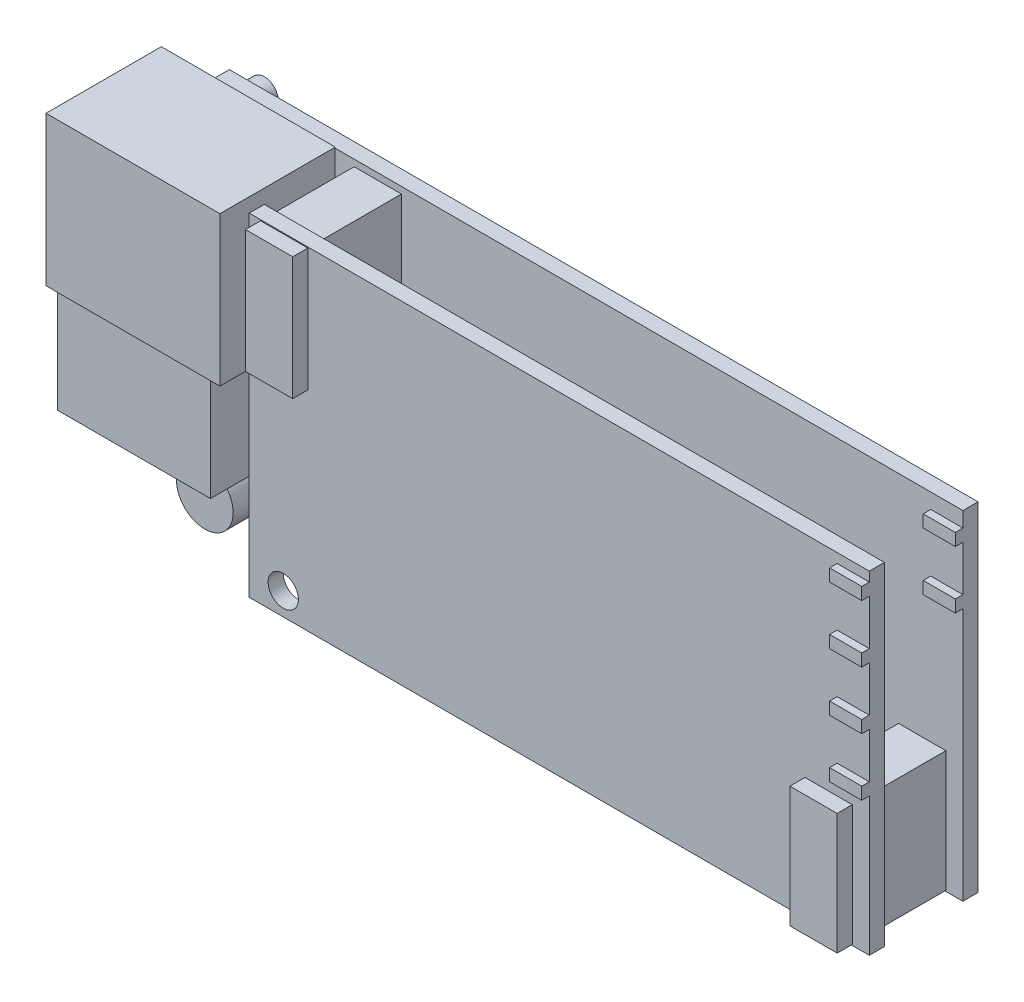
ISO-10303-21;
HEADER;
FILE_DESCRIPTION(('STEP AP214'),'2;1');
FILE_NAME('part.step','',(''),(''),'','','');
FILE_SCHEMA(('AUTOMOTIVE_DESIGN { 1 0 10303 214 1 1 1 1 }'));
ENDSEC;
DATA;
#1=APPLICATION_CONTEXT('core data for automotive mechanical design processes');
#2=APPLICATION_PROTOCOL_DEFINITION('international standard','automotive_design',2000,#1);
#3=PRODUCT_CONTEXT('',#1,'mechanical');
#4=PRODUCT('Part','Part','',(#3));
#5=PRODUCT_RELATED_PRODUCT_CATEGORY('part','',(#4));
#6=PRODUCT_DEFINITION_FORMATION('','',#4);
#7=PRODUCT_DEFINITION_CONTEXT('part definition',#1,'design');
#8=PRODUCT_DEFINITION('design','',#6,#7);
#9=PRODUCT_DEFINITION_SHAPE('','',#8);
#10=(LENGTH_UNIT() NAMED_UNIT(*) SI_UNIT(.MILLI.,.METRE.));
#11=(NAMED_UNIT(*) PLANE_ANGLE_UNIT() SI_UNIT($,.RADIAN.));
#12=(NAMED_UNIT(*) SI_UNIT($,.STERADIAN.) SOLID_ANGLE_UNIT());
#13=UNCERTAINTY_MEASURE_WITH_UNIT(LENGTH_MEASURE(1.E-05),#10,'distance_accuracy_value','');
#14=(GEOMETRIC_REPRESENTATION_CONTEXT(3) GLOBAL_UNCERTAINTY_ASSIGNED_CONTEXT((#13)) GLOBAL_UNIT_ASSIGNED_CONTEXT((#10,
#11,#12)) REPRESENTATION_CONTEXT('',''));
#15=CARTESIAN_POINT('',(0.,0.,0.));
#16=DIRECTION('',(0.,0.,1.));
#17=DIRECTION('',(1.,0.,0.));
#18=AXIS2_PLACEMENT_3D('',#15,#16,#17);
#19=CARTESIAN_POINT('',(0.,0.,0.));
#20=DIRECTION('',(0.,0.,1.));
#21=DIRECTION('',(1.,0.,0.));
#22=AXIS2_PLACEMENT_3D('',#19,#20,#21);
#23=PLANE('',#22);
#24=CARTESIAN_POINT('',(-31.2307692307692,14.5230769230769,0.));
#25=DIRECTION('',(0.,0.,1.));
#26=DIRECTION('',(1.,0.,0.));
#27=AXIS2_PLACEMENT_3D('',#24,#25,#26);
#28=CIRCLE('',#27,1.5);
#29=CARTESIAN_POINT('',(-29.7307692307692,14.5230769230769,0.));
#30=VERTEX_POINT('',#29);
#31=EDGE_CURVE('E2333',#30,#30,#28,.T.);
#32=ORIENTED_EDGE('',*,*,#31,.T.);
#33=EDGE_LOOP('',(#32));
#34=FACE_BOUND('',#33,.T.);
#35=CARTESIAN_POINT('',(-16.0307692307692,-16.8769230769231,0.));
#36=DIRECTION('',(0.,0.,1.));
#37=DIRECTION('',(1.,0.,0.));
#38=AXIS2_PLACEMENT_3D('',#35,#36,#37);
#39=CIRCLE('',#38,1.6);
#40=CARTESIAN_POINT('',(-14.4307692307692,-16.8769230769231,0.));
#41=VERTEX_POINT('',#40);
#42=EDGE_CURVE('E2329',#41,#41,#39,.T.);
#43=ORIENTED_EDGE('',*,*,#42,.T.);
#44=EDGE_LOOP('',(#43));
#45=FACE_BOUND('',#44,.T.);
#46=DIRECTION('',(0.,1.,0.));
#47=VECTOR('',#46,1.);
#48=CARTESIAN_POINT('',(23.5692307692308,-11.0769230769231,0.));
#49=LINE('',#48,#47);
#50=CARTESIAN_POINT('',(23.5692307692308,-11.0769230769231,0.));
#51=VERTEX_POINT('',#50);
#52=CARTESIAN_POINT('',(23.5692307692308,9.92307692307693,0.));
#53=VERTEX_POINT('',#52);
#54=EDGE_CURVE('E566',#51,#53,#49,.T.);
#55=ORIENTED_EDGE('',*,*,#54,.F.);
#56=DIRECTION('',(-1.,0.,0.));
#57=VECTOR('',#56,1.);
#58=CARTESIAN_POINT('',(23.5692307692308,-11.0769230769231,0.));
#59=LINE('',#58,#57);
#60=CARTESIAN_POINT('',(33.9692307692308,-11.0769230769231,0.));
#61=VERTEX_POINT('',#60);
#62=EDGE_CURVE('E579',#61,#51,#59,.T.);
#63=ORIENTED_EDGE('',*,*,#62,.F.);
#64=DIRECTION('',(0.,-1.,0.));
#65=VECTOR('',#64,1.);
#66=CARTESIAN_POINT('',(33.9692307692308,-11.0769230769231,0.));
#67=LINE('',#66,#65);
#68=CARTESIAN_POINT('',(33.9692307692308,9.92307692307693,0.));
#69=VERTEX_POINT('',#68);
#70=EDGE_CURVE('E588',#69,#61,#67,.T.);
#71=ORIENTED_EDGE('',*,*,#70,.F.);
#72=DIRECTION('',(1.,0.,0.));
#73=VECTOR('',#72,1.);
#74=CARTESIAN_POINT('',(23.5692307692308,9.92307692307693,0.));
#75=LINE('',#74,#73);
#76=EDGE_CURVE('E569',#53,#69,#75,.T.);
#77=ORIENTED_EDGE('',*,*,#76,.F.);
#78=EDGE_LOOP('',(#55,#63,#71,#77));
#79=FACE_BOUND('',#78,.T.);
#80=DIRECTION('',(0.,1.,0.));
#81=VECTOR('',#80,1.);
#82=CARTESIAN_POINT('',(-17.2307692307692,-9.77692307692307,0.));
#83=LINE('',#82,#81);
#84=CARTESIAN_POINT('',(-17.2307692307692,-9.77692307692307,0.));
#85=VERTEX_POINT('',#84);
#86=CARTESIAN_POINT('',(-17.2307692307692,0.223076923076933,0.));
#87=VERTEX_POINT('',#86);
#88=EDGE_CURVE('E665',#85,#87,#83,.T.);
#89=ORIENTED_EDGE('',*,*,#88,.F.);
#90=DIRECTION('',(-1.,0.,0.));
#91=VECTOR('',#90,1.);
#92=CARTESIAN_POINT('',(-17.2307692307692,-9.77692307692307,0.));
#93=LINE('',#92,#91);
#94=CARTESIAN_POINT('',(-7.23076923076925,-9.77692307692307,0.));
#95=VERTEX_POINT('',#94);
#96=EDGE_CURVE('E670',#95,#85,#93,.T.);
#97=ORIENTED_EDGE('',*,*,#96,.F.);
#98=DIRECTION('',(0.,-1.,0.));
#99=VECTOR('',#98,1.);
#100=CARTESIAN_POINT('',(-7.23076923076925,-9.77692307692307,0.));
#101=LINE('',#100,#99);
#102=CARTESIAN_POINT('',(-7.23076923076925,0.223076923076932,0.));
#103=VERTEX_POINT('',#102);
#104=EDGE_CURVE('E682',#103,#95,#101,.T.);
#105=ORIENTED_EDGE('',*,*,#104,.F.);
#106=DIRECTION('',(1.,0.,0.));
#107=VECTOR('',#106,1.);
#108=CARTESIAN_POINT('',(-17.2307692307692,0.223076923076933,0.));
#109=LINE('',#108,#107);
#110=EDGE_CURVE('E679',#87,#103,#109,.T.);
#111=ORIENTED_EDGE('',*,*,#110,.F.);
#112=EDGE_LOOP('',(#89,#97,#105,#111));
#113=FACE_BOUND('',#112,.T.);
#114=DIRECTION('',(0.,1.,0.));
#115=VECTOR('',#114,1.);
#116=CARTESIAN_POINT('',(-5.63076923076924,8.52307692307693,0.));
#117=LINE('',#116,#115);
#118=CARTESIAN_POINT('',(-5.63076923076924,8.52307692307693,0.));
#119=VERTEX_POINT('',#118);
#120=CARTESIAN_POINT('',(-5.63076923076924,14.7230769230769,0.));
#121=VERTEX_POINT('',#120);
#122=EDGE_CURVE('E731',#119,#121,#117,.T.);
#123=ORIENTED_EDGE('',*,*,#122,.F.);
#124=DIRECTION('',(-1.,0.,0.));
#125=VECTOR('',#124,1.);
#126=CARTESIAN_POINT('',(-5.63076923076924,8.52307692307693,0.));
#127=LINE('',#126,#125);
#128=CARTESIAN_POINT('',(-2.23076923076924,8.52307692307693,0.));
#129=VERTEX_POINT('',#128);
#130=EDGE_CURVE('E736',#129,#119,#127,.T.);
#131=ORIENTED_EDGE('',*,*,#130,.F.);
#132=DIRECTION('',(0.,-1.,0.));
#133=VECTOR('',#132,1.);
#134=CARTESIAN_POINT('',(-2.23076923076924,8.52307692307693,0.));
#135=LINE('',#134,#133);
#136=CARTESIAN_POINT('',(-2.23076923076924,14.7230769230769,0.));
#137=VERTEX_POINT('',#136);
#138=EDGE_CURVE('E748',#137,#129,#135,.T.);
#139=ORIENTED_EDGE('',*,*,#138,.F.);
#140=DIRECTION('',(1.,0.,0.));
#141=VECTOR('',#140,1.);
#142=CARTESIAN_POINT('',(-5.63076923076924,14.7230769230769,0.));
#143=LINE('',#142,#141);
#144=EDGE_CURVE('E745',#121,#137,#143,.T.);
#145=ORIENTED_EDGE('',*,*,#144,.F.);
#146=EDGE_LOOP('',(#123,#131,#139,#145));
#147=FACE_BOUND('',#146,.T.);
#148=DIRECTION('',(0.,-1.,0.));
#149=VECTOR('',#148,1.);
#150=CARTESIAN_POINT('',(-33.2307692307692,16.5230769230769,0.));
#151=LINE('',#150,#149);
#152=CARTESIAN_POINT('',(-33.2307692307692,16.5230769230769,0.));
#153=VERTEX_POINT('',#152);
#154=CARTESIAN_POINT('',(-33.2307692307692,-19.2769230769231,0.));
#155=VERTEX_POINT('',#154);
#156=EDGE_CURVE('E895',#153,#155,#151,.T.);
#157=ORIENTED_EDGE('',*,*,#156,.F.);
#158=DIRECTION('',(-1.,0.,0.));
#159=VECTOR('',#158,1.);
#160=CARTESIAN_POINT('',(-33.2307692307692,16.5230769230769,0.));
#161=LINE('',#160,#159);
#162=CARTESIAN_POINT('',(45.9692307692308,16.5230769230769,0.));
#163=VERTEX_POINT('',#162);
#164=EDGE_CURVE('E918',#163,#153,#161,.T.);
#165=ORIENTED_EDGE('',*,*,#164,.F.);
#166=DIRECTION('',(0.,1.,0.));
#167=VECTOR('',#166,1.);
#168=CARTESIAN_POINT('',(45.9692307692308,16.5230769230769,0.));
#169=LINE('',#168,#167);
#170=CARTESIAN_POINT('',(45.9692307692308,-19.2769230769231,0.));
#171=VERTEX_POINT('',#170);
#172=EDGE_CURVE('E916',#171,#163,#169,.T.);
#173=ORIENTED_EDGE('',*,*,#172,.F.);
#174=DIRECTION('',(1.,0.,0.));
#175=VECTOR('',#174,1.);
#176=CARTESIAN_POINT('',(-33.2307692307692,-19.2769230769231,0.));
#177=LINE('',#176,#175);
#178=EDGE_CURVE('E914',#155,#171,#177,.T.);
#179=ORIENTED_EDGE('',*,*,#178,.F.);
#180=EDGE_LOOP('',(#157,#165,#173,#179));
#181=FACE_BOUND('',#180,.T.);
#182=DIRECTION('',(0.,1.,0.));
#183=VECTOR('',#182,1.);
#184=CARTESIAN_POINT('',(8.16923076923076,8.52307692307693,0.));
#185=LINE('',#184,#183);
#186=CARTESIAN_POINT('',(8.16923076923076,8.52307692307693,0.));
#187=VERTEX_POINT('',#186);
#188=CARTESIAN_POINT('',(8.16923076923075,14.7230769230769,0.));
#189=VERTEX_POINT('',#188);
#190=EDGE_CURVE('E698',#187,#189,#185,.T.);
#191=ORIENTED_EDGE('',*,*,#190,.F.);
#192=DIRECTION('',(-1.,0.,0.));
#193=VECTOR('',#192,1.);
#194=CARTESIAN_POINT('',(8.16923076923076,8.52307692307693,0.));
#195=LINE('',#194,#193);
#196=CARTESIAN_POINT('',(11.5692307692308,8.52307692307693,0.));
#197=VERTEX_POINT('',#196);
#198=EDGE_CURVE('E703',#197,#187,#195,.T.);
#199=ORIENTED_EDGE('',*,*,#198,.F.);
#200=DIRECTION('',(0.,-1.,0.));
#201=VECTOR('',#200,1.);
#202=CARTESIAN_POINT('',(11.5692307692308,8.52307692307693,0.));
#203=LINE('',#202,#201);
#204=CARTESIAN_POINT('',(11.5692307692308,14.7230769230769,0.));
#205=VERTEX_POINT('',#204);
#206=EDGE_CURVE('E715',#205,#197,#203,.T.);
#207=ORIENTED_EDGE('',*,*,#206,.F.);
#208=DIRECTION('',(1.,0.,0.));
#209=VECTOR('',#208,1.);
#210=CARTESIAN_POINT('',(8.16923076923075,14.7230769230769,0.));
#211=LINE('',#210,#209);
#212=EDGE_CURVE('E712',#189,#205,#211,.T.);
#213=ORIENTED_EDGE('',*,*,#212,.F.);
#214=EDGE_LOOP('',(#191,#199,#207,#213));
#215=FACE_BOUND('',#214,.T.);
#216=DIRECTION('',(0.,1.,0.));
#217=VECTOR('',#216,1.);
#218=CARTESIAN_POINT('',(1.96923076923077,-8.57692307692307,0.));
#219=LINE('',#218,#217);
#220=CARTESIAN_POINT('',(1.96923076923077,-8.57692307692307,0.));
#221=VERTEX_POINT('',#220);
#222=CARTESIAN_POINT('',(1.96923076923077,5.22307692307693,0.));
#223=VERTEX_POINT('',#222);
#224=EDGE_CURVE('E622',#221,#223,#219,.T.);
#225=ORIENTED_EDGE('',*,*,#224,.F.);
#226=DIRECTION('',(-1.,0.,0.));
#227=VECTOR('',#226,1.);
#228=CARTESIAN_POINT('',(1.96923076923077,-8.57692307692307,0.));
#229=LINE('',#228,#227);
#230=CARTESIAN_POINT('',(15.7692307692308,-8.57692307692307,0.));
#231=VERTEX_POINT('',#230);
#232=EDGE_CURVE('E637',#231,#221,#229,.T.);
#233=ORIENTED_EDGE('',*,*,#232,.F.);
#234=DIRECTION('',(0.,-1.,0.));
#235=VECTOR('',#234,1.);
#236=CARTESIAN_POINT('',(15.7692307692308,-8.57692307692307,0.));
#237=LINE('',#236,#235);
#238=CARTESIAN_POINT('',(15.7692307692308,5.22307692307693,0.));
#239=VERTEX_POINT('',#238);
#240=EDGE_CURVE('E649',#239,#231,#237,.T.);
#241=ORIENTED_EDGE('',*,*,#240,.F.);
#242=DIRECTION('',(1.,0.,0.));
#243=VECTOR('',#242,1.);
#244=CARTESIAN_POINT('',(1.96923076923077,5.22307692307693,0.));
#245=LINE('',#244,#243);
#246=EDGE_CURVE('E646',#223,#239,#245,.T.);
#247=ORIENTED_EDGE('',*,*,#246,.F.);
#248=EDGE_LOOP('',(#225,#233,#241,#247));
#249=FACE_BOUND('',#248,.T.);
#250=DIRECTION('',(0.,1.,0.));
#251=VECTOR('',#250,1.);
#252=CARTESIAN_POINT('',(37.9692307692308,-2.27692307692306,0.));
#253=LINE('',#252,#251);
#254=CARTESIAN_POINT('',(37.9692307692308,-2.27692307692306,0.));
#255=VERTEX_POINT('',#254);
#256=CARTESIAN_POINT('',(37.9692307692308,1.32307692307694,0.));
#257=VERTEX_POINT('',#256);
#258=EDGE_CURVE('E565',#255,#257,#253,.T.);
#259=ORIENTED_EDGE('',*,*,#258,.F.);
#260=DIRECTION('',(-1.,0.,0.));
#261=VECTOR('',#260,1.);
#262=CARTESIAN_POINT('',(37.9692307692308,-2.27692307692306,0.));
#263=LINE('',#262,#261);
#264=CARTESIAN_POINT('',(39.4692307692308,-2.27692307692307,0.));
#265=VERTEX_POINT('',#264);
#266=EDGE_CURVE('E562',#265,#255,#263,.T.);
#267=ORIENTED_EDGE('',*,*,#266,.F.);
#268=DIRECTION('',(0.,-1.,0.));
#269=VECTOR('',#268,1.);
#270=CARTESIAN_POINT('',(39.4692307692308,-2.27692307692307,0.));
#271=LINE('',#270,#269);
#272=CARTESIAN_POINT('',(39.4692307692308,1.32307692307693,0.));
#273=VERTEX_POINT('',#272);
#274=EDGE_CURVE('E56',#273,#265,#271,.T.);
#275=ORIENTED_EDGE('',*,*,#274,.F.);
#276=DIRECTION('',(1.,0.,0.));
#277=VECTOR('',#276,1.);
#278=CARTESIAN_POINT('',(37.9692307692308,1.32307692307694,0.));
#279=LINE('',#278,#277);
#280=EDGE_CURVE('E51',#257,#273,#279,.T.);
#281=ORIENTED_EDGE('',*,*,#280,.F.);
#282=EDGE_LOOP('',(#259,#267,#275,#281));
#283=FACE_BOUND('',#282,.T.);
#284=ADVANCED_FACE('F35',(#34,#45,#79,#113,#147,#181,#215,#249,#283),#23,.F.);
#285=CARTESIAN_POINT('',(0.,0.,9.9));
#286=DIRECTION('',(0.,0.,1.));
#287=DIRECTION('',(1.,0.,0.));
#288=AXIS2_PLACEMENT_3D('',#285,#286,#287);
#289=PLANE('',#288);
#290=CARTESIAN_POINT('',(-16.0307692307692,-16.8769230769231,9.9));
#291=DIRECTION('',(0.,0.,1.));
#292=DIRECTION('',(1.,0.,0.));
#293=AXIS2_PLACEMENT_3D('',#290,#291,#292);
#294=CIRCLE('',#293,1.6);
#295=CARTESIAN_POINT('',(-14.4307692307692,-16.8769230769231,9.9));
#296=VERTEX_POINT('',#295);
#297=EDGE_CURVE('E2314',#296,#296,#294,.F.);
#298=ORIENTED_EDGE('',*,*,#297,.F.);
#299=EDGE_LOOP('',(#298));
#300=FACE_BOUND('',#299,.T.);
#301=DIRECTION('',(0.,-1.,0.));
#302=VECTOR('',#301,1.);
#303=CARTESIAN_POINT('',(39.1692307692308,-6.37692307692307,9.9));
#304=LINE('',#303,#302);
#305=CARTESIAN_POINT('',(39.1692307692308,-6.37692307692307,9.9));
#306=VERTEX_POINT('',#305);
#307=CARTESIAN_POINT('',(39.1692307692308,-19.1769230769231,9.9));
#308=VERTEX_POINT('',#307);
#309=EDGE_CURVE('E956',#306,#308,#304,.T.);
#310=ORIENTED_EDGE('',*,*,#309,.T.);
#311=DIRECTION('',(1.,0.,0.));
#312=VECTOR('',#311,1.);
#313=CARTESIAN_POINT('',(39.1692307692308,-19.1769230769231,9.9));
#314=LINE('',#313,#312);
#315=CARTESIAN_POINT('',(44.1692307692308,-19.1769230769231,9.9));
#316=VERTEX_POINT('',#315);
#317=EDGE_CURVE('E954',#308,#316,#314,.T.);
#318=ORIENTED_EDGE('',*,*,#317,.T.);
#319=DIRECTION('',(0.,1.,0.));
#320=VECTOR('',#319,1.);
#321=CARTESIAN_POINT('',(44.1692307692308,-6.37692307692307,9.9));
#322=LINE('',#321,#320);
#323=CARTESIAN_POINT('',(44.1692307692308,-6.37692307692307,9.9));
#324=VERTEX_POINT('',#323);
#325=EDGE_CURVE('E951',#316,#324,#322,.T.);
#326=ORIENTED_EDGE('',*,*,#325,.T.);
#327=DIRECTION('',(-1.,0.,0.));
#328=VECTOR('',#327,1.);
#329=CARTESIAN_POINT('',(39.1692307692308,-6.37692307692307,9.9));
#330=LINE('',#329,#328);
#331=EDGE_CURVE('E938',#324,#306,#330,.T.);
#332=ORIENTED_EDGE('',*,*,#331,.T.);
#333=EDGE_LOOP('',(#310,#318,#326,#332));
#334=FACE_BOUND('',#333,.T.);
#335=DIRECTION('',(0.,1.,0.));
#336=VECTOR('',#335,1.);
#337=CARTESIAN_POINT('',(45.9692307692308,-19.2769230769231,9.9));
#338=LINE('',#337,#336);
#339=CARTESIAN_POINT('',(45.9692307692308,-19.2769230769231,9.9));
#340=VERTEX_POINT('',#339);
#341=CARTESIAN_POINT('',(45.9692307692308,15.9230769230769,9.9));
#342=VERTEX_POINT('',#341);
#343=EDGE_CURVE('E1144',#340,#342,#338,.T.);
#344=ORIENTED_EDGE('',*,*,#343,.F.);
#345=DIRECTION('',(1.,0.,0.));
#346=VECTOR('',#345,1.);
#347=CARTESIAN_POINT('',(45.9692307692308,-19.2769230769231,9.9));
#348=LINE('',#347,#346);
#349=CARTESIAN_POINT('',(-19.6307692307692,-19.2769230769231,9.9));
#350=VERTEX_POINT('',#349);
#351=EDGE_CURVE('E1162',#350,#340,#348,.T.);
#352=ORIENTED_EDGE('',*,*,#351,.F.);
#353=DIRECTION('',(0.,-1.,0.));
#354=VECTOR('',#353,1.);
#355=CARTESIAN_POINT('',(-19.6307692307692,-19.2769230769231,9.9));
#356=LINE('',#355,#354);
#357=CARTESIAN_POINT('',(-19.6307692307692,15.9230769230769,9.9));
#358=VERTEX_POINT('',#357);
#359=EDGE_CURVE('E1160',#358,#350,#356,.T.);
#360=ORIENTED_EDGE('',*,*,#359,.F.);
#361=DIRECTION('',(-1.,0.,0.));
#362=VECTOR('',#361,1.);
#363=CARTESIAN_POINT('',(45.9692307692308,15.9230769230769,9.9));
#364=LINE('',#363,#362);
#365=EDGE_CURVE('E1158',#342,#358,#364,.T.);
#366=ORIENTED_EDGE('',*,*,#365,.F.);
#367=EDGE_LOOP('',(#344,#352,#360,#366));
#368=FACE_BOUND('',#367,.T.);
#369=DIRECTION('',(0.,-1.,0.));
#370=VECTOR('',#369,1.);
#371=CARTESIAN_POINT('',(-18.4307692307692,15.8230769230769,9.9));
#372=LINE('',#371,#370);
#373=CARTESIAN_POINT('',(-18.4307692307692,15.8230769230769,9.9));
#374=VERTEX_POINT('',#373);
#375=CARTESIAN_POINT('',(-18.4307692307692,2.82307692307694,9.9));
#376=VERTEX_POINT('',#375);
#377=EDGE_CURVE('E625',#374,#376,#372,.T.);
#378=ORIENTED_EDGE('',*,*,#377,.T.);
#379=DIRECTION('',(1.,0.,0.));
#380=VECTOR('',#379,1.);
#381=CARTESIAN_POINT('',(-18.4307692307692,2.82307692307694,9.9));
#382=LINE('',#381,#380);
#383=CARTESIAN_POINT('',(-13.4307692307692,2.82307692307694,9.9));
#384=VERTEX_POINT('',#383);
#385=EDGE_CURVE('E623',#376,#384,#382,.T.);
#386=ORIENTED_EDGE('',*,*,#385,.T.);
#387=DIRECTION('',(0.,1.,0.));
#388=VECTOR('',#387,1.);
#389=CARTESIAN_POINT('',(-13.4307692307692,15.8230769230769,9.9));
#390=LINE('',#389,#388);
#391=CARTESIAN_POINT('',(-13.4307692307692,15.8230769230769,9.9));
#392=VERTEX_POINT('',#391);
#393=EDGE_CURVE('E620',#384,#392,#390,.T.);
#394=ORIENTED_EDGE('',*,*,#393,.T.);
#395=DIRECTION('',(-1.,0.,0.));
#396=VECTOR('',#395,1.);
#397=CARTESIAN_POINT('',(-18.4307692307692,15.8230769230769,9.9));
#398=LINE('',#397,#396);
#399=EDGE_CURVE('E608',#392,#374,#398,.T.);
#400=ORIENTED_EDGE('',*,*,#399,.T.);
#401=EDGE_LOOP('',(#378,#386,#394,#400));
#402=FACE_BOUND('',#401,.T.);
#403=ADVANCED_FACE('F1181',(#300,#334,#368,#402),#289,.F.);
#404=CARTESIAN_POINT('',(0.,0.,1.6));
#405=DIRECTION('',(0.,0.,1.));
#406=DIRECTION('',(1.,0.,0.));
#407=AXIS2_PLACEMENT_3D('',#404,#405,#406);
#408=PLANE('',#407);
#409=CARTESIAN_POINT('',(-16.0307692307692,-16.8769230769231,1.6));
#410=DIRECTION('',(0.,0.,1.));
#411=DIRECTION('',(1.,0.,0.));
#412=AXIS2_PLACEMENT_3D('',#409,#410,#411);
#413=CIRCLE('',#412,1.6);
#414=CARTESIAN_POINT('',(-14.4307692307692,-16.8769230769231,1.6));
#415=VERTEX_POINT('',#414);
#416=EDGE_CURVE('E2236',#415,#415,#413,.F.);
#417=ORIENTED_EDGE('',*,*,#416,.T.);
#418=EDGE_LOOP('',(#417));
#419=FACE_BOUND('',#418,.T.);
#420=DIRECTION('',(0.,1.,0.));
#421=VECTOR('',#420,1.);
#422=CARTESIAN_POINT('',(45.9692307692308,16.5230769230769,1.6));
#423=LINE('',#422,#421);
#424=CARTESIAN_POINT('',(45.9692307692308,-19.2769230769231,1.6));
#425=VERTEX_POINT('',#424);
#426=CARTESIAN_POINT('',(45.9692307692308,7.52307692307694,1.6));
#427=VERTEX_POINT('',#426);
#428=EDGE_CURVE('E904',#425,#427,#423,.T.);
#429=ORIENTED_EDGE('',*,*,#428,.T.);
#430=DIRECTION('',(1.,0.,0.));
#431=VECTOR('',#430,1.);
#432=CARTESIAN_POINT('',(42.5692307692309,7.52307692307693,1.6));
#433=LINE('',#432,#431);
#434=CARTESIAN_POINT('',(42.5692307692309,7.52307692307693,1.6));
#435=VERTEX_POINT('',#434);
#436=EDGE_CURVE('E778',#435,#427,#433,.T.);
#437=ORIENTED_EDGE('',*,*,#436,.F.);
#438=DIRECTION('',(0.,-1.,0.));
#439=VECTOR('',#438,1.);
#440=CARTESIAN_POINT('',(42.5692307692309,7.52307692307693,1.6));
#441=LINE('',#440,#439);
#442=CARTESIAN_POINT('',(42.5692307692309,8.82307692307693,1.6));
#443=VERTEX_POINT('',#442);
#444=EDGE_CURVE('E764',#443,#435,#441,.T.);
#445=ORIENTED_EDGE('',*,*,#444,.F.);
#446=DIRECTION('',(-1.,0.,0.));
#447=VECTOR('',#446,1.);
#448=CARTESIAN_POINT('',(42.5692307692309,8.82307692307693,1.6));
#449=LINE('',#448,#447);
#450=CARTESIAN_POINT('',(45.9692307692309,8.82307692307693,1.6));
#451=VERTEX_POINT('',#450);
#452=EDGE_CURVE('E769',#451,#443,#449,.T.);
#453=ORIENTED_EDGE('',*,*,#452,.F.);
#454=CARTESIAN_POINT('',(45.9692307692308,13.6230769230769,1.6));
#455=VERTEX_POINT('',#454);
#456=EDGE_CURVE('E907',#451,#455,#423,.T.);
#457=ORIENTED_EDGE('',*,*,#456,.T.);
#458=DIRECTION('',(1.,0.,0.));
#459=VECTOR('',#458,1.);
#460=CARTESIAN_POINT('',(42.5692307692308,13.6230769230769,1.6));
#461=LINE('',#460,#459);
#462=CARTESIAN_POINT('',(42.5692307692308,13.6230769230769,1.6));
#463=VERTEX_POINT('',#462);
#464=EDGE_CURVE('E808',#463,#455,#461,.T.);
#465=ORIENTED_EDGE('',*,*,#464,.F.);
#466=DIRECTION('',(0.,-1.,0.));
#467=VECTOR('',#466,1.);
#468=CARTESIAN_POINT('',(42.5692307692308,13.6230769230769,1.6));
#469=LINE('',#468,#467);
#470=CARTESIAN_POINT('',(42.5692307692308,14.9230769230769,1.6));
#471=VERTEX_POINT('',#470);
#472=EDGE_CURVE('E794',#471,#463,#469,.T.);
#473=ORIENTED_EDGE('',*,*,#472,.F.);
#474=DIRECTION('',(-1.,0.,0.));
#475=VECTOR('',#474,1.);
#476=CARTESIAN_POINT('',(42.5692307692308,14.9230769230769,1.6));
#477=LINE('',#476,#475);
#478=CARTESIAN_POINT('',(45.9692307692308,14.9230769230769,1.6));
#479=VERTEX_POINT('',#478);
#480=EDGE_CURVE('E799',#479,#471,#477,.T.);
#481=ORIENTED_EDGE('',*,*,#480,.F.);
#482=CARTESIAN_POINT('',(45.9692307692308,16.5230769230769,1.6));
#483=VERTEX_POINT('',#482);
#484=EDGE_CURVE('E903',#479,#483,#423,.T.);
#485=ORIENTED_EDGE('',*,*,#484,.T.);
#486=DIRECTION('',(-1.,0.,0.));
#487=VECTOR('',#486,1.);
#488=CARTESIAN_POINT('',(-33.2307692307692,16.5230769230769,1.6));
#489=LINE('',#488,#487);
#490=CARTESIAN_POINT('',(-20.4307692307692,16.5230769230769,1.6));
#491=VERTEX_POINT('',#490);
#492=EDGE_CURVE('E908',#483,#491,#489,.T.);
#493=ORIENTED_EDGE('',*,*,#492,.T.);
#494=DIRECTION('',(0.,1.,0.));
#495=VECTOR('',#494,1.);
#496=CARTESIAN_POINT('',(-20.4307692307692,16.6230769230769,1.6));
#497=LINE('',#496,#495);
#498=CARTESIAN_POINT('',(-20.4307692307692,0.82307692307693,1.6));
#499=VERTEX_POINT('',#498);
#500=EDGE_CURVE('E880',#499,#491,#497,.T.);
#501=ORIENTED_EDGE('',*,*,#500,.F.);
#502=DIRECTION('',(1.,0.,0.));
#503=VECTOR('',#502,1.);
#504=CARTESIAN_POINT('',(-38.8307692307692,0.82307692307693,1.6));
#505=LINE('',#504,#503);
#506=CARTESIAN_POINT('',(-33.2307692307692,0.823076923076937,1.6));
#507=VERTEX_POINT('',#506);
#508=EDGE_CURVE('E879',#507,#499,#505,.T.);
#509=ORIENTED_EDGE('',*,*,#508,.F.);
#510=DIRECTION('',(0.,-1.,0.));
#511=VECTOR('',#510,1.);
#512=CARTESIAN_POINT('',(-33.2307692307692,16.5230769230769,1.6));
#513=LINE('',#512,#511);
#514=CARTESIAN_POINT('',(-33.2307692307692,0.623076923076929,1.6));
#515=VERTEX_POINT('',#514);
#516=EDGE_CURVE('E900',#507,#515,#513,.T.);
#517=ORIENTED_EDGE('',*,*,#516,.T.);
#518=DIRECTION('',(-1.,0.,0.));
#519=VECTOR('',#518,1.);
#520=CARTESIAN_POINT('',(-22.8307692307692,0.623076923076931,1.6));
#521=LINE('',#520,#519);
#522=CARTESIAN_POINT('',(-22.8307692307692,0.623076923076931,1.6));
#523=VERTEX_POINT('',#522);
#524=EDGE_CURVE('E845',#523,#515,#521,.T.);
#525=ORIENTED_EDGE('',*,*,#524,.F.);
#526=DIRECTION('',(0.,1.,0.));
#527=VECTOR('',#526,1.);
#528=CARTESIAN_POINT('',(-22.8307692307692,0.623076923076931,1.6));
#529=LINE('',#528,#527);
#530=CARTESIAN_POINT('',(-22.8307692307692,-11.3769230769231,1.6));
#531=VERTEX_POINT('',#530);
#532=EDGE_CURVE('E828',#531,#523,#529,.T.);
#533=ORIENTED_EDGE('',*,*,#532,.F.);
#534=DIRECTION('',(-1.,0.,0.));
#535=VECTOR('',#534,1.);
#536=CARTESIAN_POINT('',(0.,-11.3769230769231,1.6));
#537=LINE('',#536,#535);
#538=CARTESIAN_POINT('',(-33.2307692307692,-11.3769230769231,1.6));
#539=VERTEX_POINT('',#538);
#540=EDGE_CURVE('E931',#531,#539,#537,.T.);
#541=ORIENTED_EDGE('',*,*,#540,.T.);
#542=CARTESIAN_POINT('',(-33.2307692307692,-19.2769230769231,1.6));
#543=VERTEX_POINT('',#542);
#544=EDGE_CURVE('E901',#539,#543,#513,.T.);
#545=ORIENTED_EDGE('',*,*,#544,.T.);
#546=DIRECTION('',(1.,0.,0.));
#547=VECTOR('',#546,1.);
#548=CARTESIAN_POINT('',(-33.2307692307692,-19.2769230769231,1.6));
#549=LINE('',#548,#547);
#550=EDGE_CURVE('E899',#543,#425,#549,.T.);
#551=ORIENTED_EDGE('',*,*,#550,.T.);
#552=EDGE_LOOP('',(#429,#437,#445,#453,#457,#465,#473,#481,#485,#493,#501,#509,#517,#525,#533,
#541,#545,#551));
#553=FACE_BOUND('',#552,.T.);
#554=CARTESIAN_POINT('',(-27.2307692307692,-15.2769230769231,1.6));
#555=DIRECTION('',(0.,0.,1.));
#556=DIRECTION('',(1.,0.,0.));
#557=AXIS2_PLACEMENT_3D('',#554,#555,#556);
#558=CIRCLE('',#557,3.);
#559=CARTESIAN_POINT('',(-24.2307692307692,-15.2769230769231,1.6));
#560=VERTEX_POINT('',#559);
#561=EDGE_CURVE('E824',#560,#560,#558,.T.);
#562=ORIENTED_EDGE('',*,*,#561,.F.);
#563=EDGE_LOOP('',(#562));
#564=FACE_BOUND('',#563,.T.);
#565=DIRECTION('',(0.,-1.,0.));
#566=VECTOR('',#565,1.);
#567=CARTESIAN_POINT('',(39.1692307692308,-6.37692307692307,1.6));
#568=LINE('',#567,#566);
#569=CARTESIAN_POINT('',(39.1692307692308,-6.37692307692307,1.6));
#570=VERTEX_POINT('',#569);
#571=CARTESIAN_POINT('',(39.1692307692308,-19.1769230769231,1.6));
#572=VERTEX_POINT('',#571);
#573=EDGE_CURVE('E948',#570,#572,#568,.T.);
#574=ORIENTED_EDGE('',*,*,#573,.F.);
#575=DIRECTION('',(-1.,0.,0.));
#576=VECTOR('',#575,1.);
#577=CARTESIAN_POINT('',(39.1692307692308,-6.37692307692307,1.6));
#578=LINE('',#577,#576);
#579=CARTESIAN_POINT('',(44.1692307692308,-6.37692307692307,1.6));
#580=VERTEX_POINT('',#579);
#581=EDGE_CURVE('E935',#580,#570,#578,.T.);
#582=ORIENTED_EDGE('',*,*,#581,.F.);
#583=DIRECTION('',(0.,1.,0.));
#584=VECTOR('',#583,1.);
#585=CARTESIAN_POINT('',(44.1692307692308,-6.37692307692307,1.6));
#586=LINE('',#585,#584);
#587=CARTESIAN_POINT('',(44.1692307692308,-19.1769230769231,1.6));
#588=VERTEX_POINT('',#587);
#589=EDGE_CURVE('E940',#588,#580,#586,.T.);
#590=ORIENTED_EDGE('',*,*,#589,.F.);
#591=DIRECTION('',(1.,0.,0.));
#592=VECTOR('',#591,1.);
#593=CARTESIAN_POINT('',(39.1692307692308,-19.1769230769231,1.6));
#594=LINE('',#593,#592);
#595=EDGE_CURVE('E944',#572,#588,#594,.T.);
#596=ORIENTED_EDGE('',*,*,#595,.F.);
#597=EDGE_LOOP('',(#574,#582,#590,#596));
#598=FACE_BOUND('',#597,.T.);
#599=DIRECTION('',(1.,0.,0.));
#600=VECTOR('',#599,1.);
#601=CARTESIAN_POINT('',(-18.4307692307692,2.82307692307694,1.6));
#602=LINE('',#601,#600);
#603=CARTESIAN_POINT('',(-18.4307692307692,2.82307692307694,1.6));
#604=VERTEX_POINT('',#603);
#605=CARTESIAN_POINT('',(-13.4307692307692,2.82307692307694,1.6));
#606=VERTEX_POINT('',#605);
#607=EDGE_CURVE('E613',#604,#606,#602,.T.);
#608=ORIENTED_EDGE('',*,*,#607,.F.);
#609=DIRECTION('',(0.,-1.,0.));
#610=VECTOR('',#609,1.);
#611=CARTESIAN_POINT('',(-18.4307692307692,15.8230769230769,1.6));
#612=LINE('',#611,#610);
#613=CARTESIAN_POINT('',(-18.4307692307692,15.8230769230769,1.6));
#614=VERTEX_POINT('',#613);
#615=EDGE_CURVE('E617',#614,#604,#612,.T.);
#616=ORIENTED_EDGE('',*,*,#615,.F.);
#617=DIRECTION('',(-1.,0.,0.));
#618=VECTOR('',#617,1.);
#619=CARTESIAN_POINT('',(-18.4307692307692,15.8230769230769,1.6));
#620=LINE('',#619,#618);
#621=CARTESIAN_POINT('',(-13.4307692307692,15.8230769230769,1.6));
#622=VERTEX_POINT('',#621);
#623=EDGE_CURVE('E605',#622,#614,#620,.T.);
#624=ORIENTED_EDGE('',*,*,#623,.F.);
#625=DIRECTION('',(0.,1.,0.));
#626=VECTOR('',#625,1.);
#627=CARTESIAN_POINT('',(-13.4307692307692,15.8230769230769,1.6));
#628=LINE('',#627,#626);
#629=EDGE_CURVE('E610',#606,#622,#628,.T.);
#630=ORIENTED_EDGE('',*,*,#629,.F.);
#631=EDGE_LOOP('',(#608,#616,#624,#630));
#632=FACE_BOUND('',#631,.T.);
#633=ADVANCED_FACE('F1227',(#419,#553,#564,#598,#632),#408,.T.);
#634=CARTESIAN_POINT('',(0.,0.,11.5));
#635=DIRECTION('',(0.,0.,1.));
#636=DIRECTION('',(1.,0.,0.));
#637=AXIS2_PLACEMENT_3D('',#634,#635,#636);
#638=PLANE('',#637);
#639=CARTESIAN_POINT('',(-16.0307692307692,-16.8769230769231,11.5));
#640=DIRECTION('',(0.,0.,1.));
#641=DIRECTION('',(1.,0.,0.));
#642=AXIS2_PLACEMENT_3D('',#639,#640,#641);
#643=CIRCLE('',#642,1.6);
#644=CARTESIAN_POINT('',(-14.4307692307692,-16.8769230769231,11.5));
#645=VERTEX_POINT('',#644);
#646=EDGE_CURVE('E39',#645,#645,#643,.F.);
#647=ORIENTED_EDGE('',*,*,#646,.T.);
#648=EDGE_LOOP('',(#647));
#649=FACE_BOUND('',#648,.T.);
#650=DIRECTION('',(1.,0.,0.));
#651=VECTOR('',#650,1.);
#652=CARTESIAN_POINT('',(39.1692307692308,-19.1769230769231,11.5));
#653=LINE('',#652,#651);
#654=CARTESIAN_POINT('',(39.1692307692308,-19.1769230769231,11.5));
#655=VERTEX_POINT('',#654);
#656=CARTESIAN_POINT('',(44.1692307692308,-19.1769230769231,11.5));
#657=VERTEX_POINT('',#656);
#658=EDGE_CURVE('E1129',#655,#657,#653,.T.);
#659=ORIENTED_EDGE('',*,*,#658,.F.);
#660=DIRECTION('',(0.,-1.,0.));
#661=VECTOR('',#660,1.);
#662=CARTESIAN_POINT('',(39.1692307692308,-6.37692307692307,11.5));
#663=LINE('',#662,#661);
#664=CARTESIAN_POINT('',(39.1692307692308,-6.37692307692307,11.5));
#665=VERTEX_POINT('',#664);
#666=EDGE_CURVE('E1115',#665,#655,#663,.T.);
#667=ORIENTED_EDGE('',*,*,#666,.F.);
#668=DIRECTION('',(-1.,0.,0.));
#669=VECTOR('',#668,1.);
#670=CARTESIAN_POINT('',(39.1692307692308,-6.37692307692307,11.5));
#671=LINE('',#670,#669);
#672=CARTESIAN_POINT('',(44.1692307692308,-6.37692307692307,11.5));
#673=VERTEX_POINT('',#672);
#674=EDGE_CURVE('E1120',#673,#665,#671,.T.);
#675=ORIENTED_EDGE('',*,*,#674,.F.);
#676=DIRECTION('',(0.,1.,0.));
#677=VECTOR('',#676,1.);
#678=CARTESIAN_POINT('',(44.1692307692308,-6.37692307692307,11.5));
#679=LINE('',#678,#677);
#680=EDGE_CURVE('E1131',#657,#673,#679,.T.);
#681=ORIENTED_EDGE('',*,*,#680,.F.);
#682=EDGE_LOOP('',(#659,#667,#675,#681));
#683=FACE_BOUND('',#682,.T.);
#684=DIRECTION('',(1.,0.,0.));
#685=VECTOR('',#684,1.);
#686=CARTESIAN_POINT('',(-18.4307692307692,2.82307692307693,11.5));
#687=LINE('',#686,#685);
#688=CARTESIAN_POINT('',(-18.4307692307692,2.82307692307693,11.5));
#689=VERTEX_POINT('',#688);
#690=CARTESIAN_POINT('',(-13.4307692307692,2.82307692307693,11.5));
#691=VERTEX_POINT('',#690);
#692=EDGE_CURVE('E1100',#689,#691,#687,.T.);
#693=ORIENTED_EDGE('',*,*,#692,.F.);
#694=DIRECTION('',(0.,-1.,0.));
#695=VECTOR('',#694,1.);
#696=CARTESIAN_POINT('',(-18.4307692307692,15.8230769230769,11.5));
#697=LINE('',#696,#695);
#698=CARTESIAN_POINT('',(-18.4307692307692,15.8230769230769,11.5));
#699=VERTEX_POINT('',#698);
#700=EDGE_CURVE('E1086',#699,#689,#697,.T.);
#701=ORIENTED_EDGE('',*,*,#700,.F.);
#702=DIRECTION('',(-1.,0.,0.));
#703=VECTOR('',#702,1.);
#704=CARTESIAN_POINT('',(-18.4307692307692,15.8230769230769,11.5));
#705=LINE('',#704,#703);
#706=CARTESIAN_POINT('',(-13.4307692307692,15.8230769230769,11.5));
#707=VERTEX_POINT('',#706);
#708=EDGE_CURVE('E1091',#707,#699,#705,.T.);
#709=ORIENTED_EDGE('',*,*,#708,.F.);
#710=DIRECTION('',(0.,1.,0.));
#711=VECTOR('',#710,1.);
#712=CARTESIAN_POINT('',(-13.4307692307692,15.8230769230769,11.5));
#713=LINE('',#712,#711);
#714=EDGE_CURVE('E1102',#691,#707,#713,.T.);
#715=ORIENTED_EDGE('',*,*,#714,.F.);
#716=EDGE_LOOP('',(#693,#701,#709,#715));
#717=FACE_BOUND('',#716,.T.);
#718=DIRECTION('',(0.,-1.,0.));
#719=VECTOR('',#718,1.);
#720=CARTESIAN_POINT('',(42.5692307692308,-3.37692307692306,11.5));
#721=LINE('',#720,#719);
#722=CARTESIAN_POINT('',(42.5692307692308,-3.37692307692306,11.5));
#723=VERTEX_POINT('',#722);
#724=CARTESIAN_POINT('',(42.5692307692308,-4.67692307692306,11.5));
#725=VERTEX_POINT('',#724);
#726=EDGE_CURVE('E980',#723,#725,#721,.T.);
#727=ORIENTED_EDGE('',*,*,#726,.F.);
#728=DIRECTION('',(-1.,0.,0.));
#729=VECTOR('',#728,1.);
#730=CARTESIAN_POINT('',(42.5692307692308,-3.37692307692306,11.5));
#731=LINE('',#730,#729);
#732=CARTESIAN_POINT('',(45.9692307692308,-3.37692307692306,11.5));
#733=VERTEX_POINT('',#732);
#734=EDGE_CURVE('E953',#733,#723,#731,.T.);
#735=ORIENTED_EDGE('',*,*,#734,.F.);
#736=DIRECTION('',(0.,1.,0.));
#737=VECTOR('',#736,1.);
#738=CARTESIAN_POINT('',(45.9692307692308,-19.2769230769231,11.5));
#739=LINE('',#738,#737);
#740=CARTESIAN_POINT('',(45.9692307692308,1.42307692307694,11.5));
#741=VERTEX_POINT('',#740);
#742=EDGE_CURVE('E1148',#733,#741,#739,.T.);
#743=ORIENTED_EDGE('',*,*,#742,.T.);
#744=DIRECTION('',(1.,0.,0.));
#745=VECTOR('',#744,1.);
#746=CARTESIAN_POINT('',(42.5692307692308,1.42307692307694,11.5));
#747=LINE('',#746,#745);
#748=CARTESIAN_POINT('',(42.5692307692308,1.42307692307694,11.5));
#749=VERTEX_POINT('',#748);
#750=EDGE_CURVE('E1001',#749,#741,#747,.T.);
#751=ORIENTED_EDGE('',*,*,#750,.F.);
#752=DIRECTION('',(0.,-1.,0.));
#753=VECTOR('',#752,1.);
#754=CARTESIAN_POINT('',(42.5692307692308,2.72307692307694,11.5));
#755=LINE('',#754,#753);
#756=CARTESIAN_POINT('',(42.5692307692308,2.72307692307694,11.5));
#757=VERTEX_POINT('',#756);
#758=EDGE_CURVE('E1010',#757,#749,#755,.T.);
#759=ORIENTED_EDGE('',*,*,#758,.F.);
#760=DIRECTION('',(-1.,0.,0.));
#761=VECTOR('',#760,1.);
#762=CARTESIAN_POINT('',(42.5692307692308,2.72307692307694,11.5));
#763=LINE('',#762,#761);
#764=CARTESIAN_POINT('',(45.9692307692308,2.72307692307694,11.5));
#765=VERTEX_POINT('',#764);
#766=EDGE_CURVE('E996',#765,#757,#763,.T.);
#767=ORIENTED_EDGE('',*,*,#766,.F.);
#768=CARTESIAN_POINT('',(45.9692307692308,7.52307692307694,11.5));
#769=VERTEX_POINT('',#768);
#770=EDGE_CURVE('E1208',#765,#769,#739,.T.);
#771=ORIENTED_EDGE('',*,*,#770,.T.);
#772=DIRECTION('',(1.,0.,0.));
#773=VECTOR('',#772,1.);
#774=CARTESIAN_POINT('',(42.5692307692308,7.52307692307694,11.5));
#775=LINE('',#774,#773);
#776=CARTESIAN_POINT('',(42.5692307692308,7.52307692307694,11.5));
#777=VERTEX_POINT('',#776);
#778=EDGE_CURVE('E1031',#777,#769,#775,.T.);
#779=ORIENTED_EDGE('',*,*,#778,.F.);
#780=DIRECTION('',(0.,-1.,0.));
#781=VECTOR('',#780,1.);
#782=CARTESIAN_POINT('',(42.5692307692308,8.82307692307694,11.5));
#783=LINE('',#782,#781);
#784=CARTESIAN_POINT('',(42.5692307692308,8.82307692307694,11.5));
#785=VERTEX_POINT('',#784);
#786=EDGE_CURVE('E1040',#785,#777,#783,.T.);
#787=ORIENTED_EDGE('',*,*,#786,.F.);
#788=DIRECTION('',(-1.,0.,0.));
#789=VECTOR('',#788,1.);
#790=CARTESIAN_POINT('',(42.5692307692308,8.82307692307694,11.5));
#791=LINE('',#790,#789);
#792=CARTESIAN_POINT('',(45.9692307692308,8.82307692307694,11.5));
#793=VERTEX_POINT('',#792);
#794=EDGE_CURVE('E1026',#793,#785,#791,.T.);
#795=ORIENTED_EDGE('',*,*,#794,.F.);
#796=CARTESIAN_POINT('',(45.9692307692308,13.6230769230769,11.5));
#797=VERTEX_POINT('',#796);
#798=EDGE_CURVE('E1209',#793,#797,#739,.T.);
#799=ORIENTED_EDGE('',*,*,#798,.T.);
#800=DIRECTION('',(1.,0.,0.));
#801=VECTOR('',#800,1.);
#802=CARTESIAN_POINT('',(42.5692307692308,13.6230769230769,11.5));
#803=LINE('',#802,#801);
#804=CARTESIAN_POINT('',(42.5692307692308,13.6230769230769,11.5));
#805=VERTEX_POINT('',#804);
#806=EDGE_CURVE('E1070',#805,#797,#803,.T.);
#807=ORIENTED_EDGE('',*,*,#806,.F.);
#808=DIRECTION('',(0.,-1.,0.));
#809=VECTOR('',#808,1.);
#810=CARTESIAN_POINT('',(42.5692307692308,14.9230769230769,11.5));
#811=LINE('',#810,#809);
#812=CARTESIAN_POINT('',(42.5692307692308,14.9230769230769,11.5));
#813=VERTEX_POINT('',#812);
#814=EDGE_CURVE('E1056',#813,#805,#811,.T.);
#815=ORIENTED_EDGE('',*,*,#814,.F.);
#816=DIRECTION('',(-1.,0.,0.));
#817=VECTOR('',#816,1.);
#818=CARTESIAN_POINT('',(42.5692307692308,14.9230769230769,11.5));
#819=LINE('',#818,#817);
#820=CARTESIAN_POINT('',(45.9692307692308,14.9230769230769,11.5));
#821=VERTEX_POINT('',#820);
#822=EDGE_CURVE('E1061',#821,#813,#819,.T.);
#823=ORIENTED_EDGE('',*,*,#822,.F.);
#824=CARTESIAN_POINT('',(45.9692307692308,15.9230769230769,11.5));
#825=VERTEX_POINT('',#824);
#826=EDGE_CURVE('E1149',#821,#825,#739,.T.);
#827=ORIENTED_EDGE('',*,*,#826,.T.);
#828=DIRECTION('',(-1.,0.,0.));
#829=VECTOR('',#828,1.);
#830=CARTESIAN_POINT('',(45.9692307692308,15.9230769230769,11.5));
#831=LINE('',#830,#829);
#832=CARTESIAN_POINT('',(-19.6307692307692,15.9230769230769,11.5));
#833=VERTEX_POINT('',#832);
#834=EDGE_CURVE('E1147',#825,#833,#831,.T.);
#835=ORIENTED_EDGE('',*,*,#834,.T.);
#836=DIRECTION('',(0.,-1.,0.));
#837=VECTOR('',#836,1.);
#838=CARTESIAN_POINT('',(-19.6307692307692,-19.2769230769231,11.5));
#839=LINE('',#838,#837);
#840=CARTESIAN_POINT('',(-19.6307692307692,-19.2769230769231,11.5));
#841=VERTEX_POINT('',#840);
#842=EDGE_CURVE('E1151',#833,#841,#839,.T.);
#843=ORIENTED_EDGE('',*,*,#842,.T.);
#844=DIRECTION('',(1.,0.,0.));
#845=VECTOR('',#844,1.);
#846=CARTESIAN_POINT('',(45.9692307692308,-19.2769230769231,11.5));
#847=LINE('',#846,#845);
#848=CARTESIAN_POINT('',(45.9692307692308,-19.2769230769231,11.5));
#849=VERTEX_POINT('',#848);
#850=EDGE_CURVE('E1153',#841,#849,#847,.T.);
#851=ORIENTED_EDGE('',*,*,#850,.T.);
#852=CARTESIAN_POINT('',(45.9692307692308,-4.67692307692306,11.5));
#853=VERTEX_POINT('',#852);
#854=EDGE_CURVE('E1145',#849,#853,#739,.T.);
#855=ORIENTED_EDGE('',*,*,#854,.T.);
#856=DIRECTION('',(1.,0.,0.));
#857=VECTOR('',#856,1.);
#858=CARTESIAN_POINT('',(42.5692307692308,-4.67692307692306,11.5));
#859=LINE('',#858,#857);
#860=EDGE_CURVE('E971',#725,#853,#859,.T.);
#861=ORIENTED_EDGE('',*,*,#860,.F.);
#862=EDGE_LOOP('',(#727,#735,#743,#751,#759,#767,#771,#779,#787,#795,#799,#807,#815,#823,#827,
#835,#843,#851,#855,#861));
#863=FACE_BOUND('',#862,.T.);
#864=ADVANCED_FACE('F1193',(#649,#683,#717,#863),#638,.T.);
#865=CARTESIAN_POINT('',(45.9692307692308,-19.2769230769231,11.5));
#866=DIRECTION('',(-1.,0.,0.));
#867=DIRECTION('',(0.,0.,1.));
#868=AXIS2_PLACEMENT_3D('',#865,#866,#867);
#869=PLANE('',#868);
#870=ORIENTED_EDGE('',*,*,#343,.T.);
#871=DIRECTION('',(0.,0.,-1.));
#872=VECTOR('',#871,1.);
#873=CARTESIAN_POINT('',(45.9692307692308,15.9230769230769,11.5));
#874=LINE('',#873,#872);
#875=EDGE_CURVE('E11',#825,#342,#874,.T.);
#876=ORIENTED_EDGE('',*,*,#875,.F.);
#877=ORIENTED_EDGE('',*,*,#826,.F.);
#878=DIRECTION('',(0.,0.,-1.));
#879=VECTOR('',#878,1.);
#880=CARTESIAN_POINT('',(45.9692307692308,14.9230769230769,12.3));
#881=LINE('',#880,#879);
#882=CARTESIAN_POINT('',(45.9692307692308,14.9230769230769,12.3));
#883=VERTEX_POINT('',#882);
#884=EDGE_CURVE('E1077',#883,#821,#881,.T.);
#885=ORIENTED_EDGE('',*,*,#884,.F.);
#886=DIRECTION('',(0.,1.,0.));
#887=VECTOR('',#886,1.);
#888=CARTESIAN_POINT('',(45.9692307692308,14.9230769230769,12.3));
#889=LINE('',#888,#887);
#890=CARTESIAN_POINT('',(45.9692307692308,13.6230769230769,12.3));
#891=VERTEX_POINT('',#890);
#892=EDGE_CURVE('E1063',#891,#883,#889,.T.);
#893=ORIENTED_EDGE('',*,*,#892,.F.);
#894=DIRECTION('',(0.,0.,-1.));
#895=VECTOR('',#894,1.);
#896=CARTESIAN_POINT('',(45.9692307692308,13.6230769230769,12.3));
#897=LINE('',#896,#895);
#898=EDGE_CURVE('E1080',#891,#797,#897,.T.);
#899=ORIENTED_EDGE('',*,*,#898,.T.);
#900=ORIENTED_EDGE('',*,*,#798,.F.);
#901=DIRECTION('',(0.,0.,-1.));
#902=VECTOR('',#901,1.);
#903=CARTESIAN_POINT('',(45.9692307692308,8.82307692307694,12.3));
#904=LINE('',#903,#902);
#905=CARTESIAN_POINT('',(45.9692307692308,8.82307692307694,12.3));
#906=VERTEX_POINT('',#905);
#907=EDGE_CURVE('E1037',#906,#793,#904,.T.);
#908=ORIENTED_EDGE('',*,*,#907,.F.);
#909=DIRECTION('',(0.,1.,0.));
#910=VECTOR('',#909,1.);
#911=CARTESIAN_POINT('',(45.9692307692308,8.82307692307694,12.3));
#912=LINE('',#911,#910);
#913=CARTESIAN_POINT('',(45.9692307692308,7.52307692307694,12.3));
#914=VERTEX_POINT('',#913);
#915=EDGE_CURVE('E1035',#914,#906,#912,.T.);
#916=ORIENTED_EDGE('',*,*,#915,.F.);
#917=DIRECTION('',(0.,0.,-1.));
#918=VECTOR('',#917,1.);
#919=CARTESIAN_POINT('',(45.9692307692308,7.52307692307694,12.3));
#920=LINE('',#919,#918);
#921=EDGE_CURVE('E1047',#914,#769,#920,.T.);
#922=ORIENTED_EDGE('',*,*,#921,.T.);
#923=ORIENTED_EDGE('',*,*,#770,.F.);
#924=DIRECTION('',(0.,0.,-1.));
#925=VECTOR('',#924,1.);
#926=CARTESIAN_POINT('',(45.9692307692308,2.72307692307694,12.3));
#927=LINE('',#926,#925);
#928=CARTESIAN_POINT('',(45.9692307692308,2.72307692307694,12.3));
#929=VERTEX_POINT('',#928);
#930=EDGE_CURVE('E1007',#929,#765,#927,.T.);
#931=ORIENTED_EDGE('',*,*,#930,.F.);
#932=DIRECTION('',(0.,1.,0.));
#933=VECTOR('',#932,1.);
#934=CARTESIAN_POINT('',(45.9692307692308,2.72307692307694,12.3));
#935=LINE('',#934,#933);
#936=CARTESIAN_POINT('',(45.9692307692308,1.42307692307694,12.3));
#937=VERTEX_POINT('',#936);
#938=EDGE_CURVE('E1005',#937,#929,#935,.T.);
#939=ORIENTED_EDGE('',*,*,#938,.F.);
#940=DIRECTION('',(0.,0.,-1.));
#941=VECTOR('',#940,1.);
#942=CARTESIAN_POINT('',(45.9692307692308,1.42307692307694,12.3));
#943=LINE('',#942,#941);
#944=EDGE_CURVE('E1017',#937,#741,#943,.T.);
#945=ORIENTED_EDGE('',*,*,#944,.T.);
#946=ORIENTED_EDGE('',*,*,#742,.F.);
#947=DIRECTION('',(0.,0.,-1.));
#948=VECTOR('',#947,1.);
#949=CARTESIAN_POINT('',(45.9692307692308,-3.37692307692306,12.3));
#950=LINE('',#949,#948);
#951=CARTESIAN_POINT('',(45.9692307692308,-3.37692307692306,12.3));
#952=VERTEX_POINT('',#951);
#953=EDGE_CURVE('E977',#952,#733,#950,.T.);
#954=ORIENTED_EDGE('',*,*,#953,.F.);
#955=DIRECTION('',(0.,1.,0.));
#956=VECTOR('',#955,1.);
#957=CARTESIAN_POINT('',(45.9692307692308,-3.37692307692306,12.3));
#958=LINE('',#957,#956);
#959=CARTESIAN_POINT('',(45.9692307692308,-4.67692307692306,12.3));
#960=VERTEX_POINT('',#959);
#961=EDGE_CURVE('E975',#960,#952,#958,.T.);
#962=ORIENTED_EDGE('',*,*,#961,.F.);
#963=DIRECTION('',(0.,0.,-1.));
#964=VECTOR('',#963,1.);
#965=CARTESIAN_POINT('',(45.9692307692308,-4.67692307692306,12.3));
#966=LINE('',#965,#964);
#967=EDGE_CURVE('E987',#960,#853,#966,.T.);
#968=ORIENTED_EDGE('',*,*,#967,.T.);
#969=ORIENTED_EDGE('',*,*,#854,.F.);
#970=DIRECTION('',(0.,0.,-1.));
#971=VECTOR('',#970,1.);
#972=CARTESIAN_POINT('',(45.9692307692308,-19.2769230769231,11.5));
#973=LINE('',#972,#971);
#974=EDGE_CURVE('E1155',#849,#340,#973,.T.);
#975=ORIENTED_EDGE('',*,*,#974,.T.);
#976=EDGE_LOOP('',(#870,#876,#877,#885,#893,#899,#900,#908,#916,#922,#923,#931,#939,#945,#946,
#954,#962,#968,#969,#975));
#977=FACE_BOUND('',#976,.T.);
#978=ADVANCED_FACE('F37',(#977),#869,.F.);
#979=CARTESIAN_POINT('',(45.9692307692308,15.9230769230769,11.5));
#980=DIRECTION('',(0.,-1.,0.));
#981=DIRECTION('',(1.,0.,0.));
#982=AXIS2_PLACEMENT_3D('',#979,#980,#981);
#983=PLANE('',#982);
#984=ORIENTED_EDGE('',*,*,#365,.T.);
#985=DIRECTION('',(0.,0.,-1.));
#986=VECTOR('',#985,1.);
#987=CARTESIAN_POINT('',(-19.6307692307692,15.9230769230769,11.5));
#988=LINE('',#987,#986);
#989=EDGE_CURVE('E44',#833,#358,#988,.T.);
#990=ORIENTED_EDGE('',*,*,#989,.F.);
#991=ORIENTED_EDGE('',*,*,#834,.F.);
#992=ORIENTED_EDGE('',*,*,#875,.T.);
#993=EDGE_LOOP('',(#984,#990,#991,#992));
#994=FACE_BOUND('',#993,.T.);
#995=ADVANCED_FACE('F1214',(#994),#983,.F.);
#996=CARTESIAN_POINT('',(-19.6307692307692,-19.2769230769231,11.5));
#997=DIRECTION('',(1.,0.,0.));
#998=DIRECTION('',(0.,0.,-1.));
#999=AXIS2_PLACEMENT_3D('',#996,#997,#998);
#1000=PLANE('',#999);
#1001=ORIENTED_EDGE('',*,*,#359,.T.);
#1002=DIRECTION('',(0.,0.,-1.));
#1003=VECTOR('',#1002,1.);
#1004=CARTESIAN_POINT('',(-19.6307692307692,-19.2769230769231,11.5));
#1005=LINE('',#1004,#1003);
#1006=EDGE_CURVE('E1166',#841,#350,#1005,.T.);
#1007=ORIENTED_EDGE('',*,*,#1006,.F.);
#1008=ORIENTED_EDGE('',*,*,#842,.F.);
#1009=ORIENTED_EDGE('',*,*,#989,.T.);
#1010=EDGE_LOOP('',(#1001,#1007,#1008,#1009));
#1011=FACE_BOUND('',#1010,.T.);
#1012=ADVANCED_FACE('F1174',(#1011),#1000,.F.);
#1013=CARTESIAN_POINT('',(45.9692307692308,-19.2769230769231,11.5));
#1014=DIRECTION('',(0.,1.,0.));
#1015=DIRECTION('',(-1.,0.,0.));
#1016=AXIS2_PLACEMENT_3D('',#1013,#1014,#1015);
#1017=PLANE('',#1016);
#1018=ORIENTED_EDGE('',*,*,#351,.T.);
#1019=ORIENTED_EDGE('',*,*,#974,.F.);
#1020=ORIENTED_EDGE('',*,*,#850,.F.);
#1021=ORIENTED_EDGE('',*,*,#1006,.T.);
#1022=EDGE_LOOP('',(#1018,#1019,#1020,#1021));
#1023=FACE_BOUND('',#1022,.T.);
#1024=ADVANCED_FACE('F1185',(#1023),#1017,.F.);
#1025=CARTESIAN_POINT('',(39.1692307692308,-6.37692307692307,13.1));
#1026=DIRECTION('',(1.,0.,0.));
#1027=DIRECTION('',(0.,0.,-1.));
#1028=AXIS2_PLACEMENT_3D('',#1025,#1026,#1027);
#1029=PLANE('',#1028);
#1030=ORIENTED_EDGE('',*,*,#666,.T.);
#1031=DIRECTION('',(0.,0.,-1.));
#1032=VECTOR('',#1031,1.);
#1033=CARTESIAN_POINT('',(39.1692307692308,-19.1769230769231,13.1));
#1034=LINE('',#1033,#1032);
#1035=CARTESIAN_POINT('',(39.1692307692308,-19.1769230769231,13.1));
#1036=VERTEX_POINT('',#1035);
#1037=EDGE_CURVE('E1142',#1036,#655,#1034,.T.);
#1038=ORIENTED_EDGE('',*,*,#1037,.F.);
#1039=DIRECTION('',(0.,-1.,0.));
#1040=VECTOR('',#1039,1.);
#1041=CARTESIAN_POINT('',(39.1692307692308,-6.37692307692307,13.1));
#1042=LINE('',#1041,#1040);
#1043=CARTESIAN_POINT('',(39.1692307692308,-6.37692307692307,13.1));
#1044=VERTEX_POINT('',#1043);
#1045=EDGE_CURVE('E1116',#1044,#1036,#1042,.T.);
#1046=ORIENTED_EDGE('',*,*,#1045,.F.);
#1047=DIRECTION('',(0.,0.,-1.));
#1048=VECTOR('',#1047,1.);
#1049=CARTESIAN_POINT('',(39.1692307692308,-6.37692307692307,13.1));
#1050=LINE('',#1049,#1048);
#1051=EDGE_CURVE('E1126',#1044,#665,#1050,.T.);
#1052=ORIENTED_EDGE('',*,*,#1051,.T.);
#1053=EDGE_LOOP('',(#1030,#1038,#1046,#1052));
#1054=FACE_BOUND('',#1053,.T.);
#1055=ADVANCED_FACE('F1361',(#1054),#1029,.F.);
#1056=CARTESIAN_POINT('',(39.1692307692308,-19.1769230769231,13.1));
#1057=DIRECTION('',(0.,1.,0.));
#1058=DIRECTION('',(0.,0.,1.));
#1059=AXIS2_PLACEMENT_3D('',#1056,#1057,#1058);
#1060=PLANE('',#1059);
#1061=ORIENTED_EDGE('',*,*,#658,.T.);
#1062=DIRECTION('',(0.,0.,-1.));
#1063=VECTOR('',#1062,1.);
#1064=CARTESIAN_POINT('',(44.1692307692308,-19.1769230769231,13.1));
#1065=LINE('',#1064,#1063);
#1066=CARTESIAN_POINT('',(44.1692307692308,-19.1769230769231,13.1));
#1067=VERTEX_POINT('',#1066);
#1068=EDGE_CURVE('E1139',#1067,#657,#1065,.T.);
#1069=ORIENTED_EDGE('',*,*,#1068,.F.);
#1070=DIRECTION('',(1.,0.,0.));
#1071=VECTOR('',#1070,1.);
#1072=CARTESIAN_POINT('',(39.1692307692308,-19.1769230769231,13.1));
#1073=LINE('',#1072,#1071);
#1074=EDGE_CURVE('E1119',#1036,#1067,#1073,.T.);
#1075=ORIENTED_EDGE('',*,*,#1074,.F.);
#1076=ORIENTED_EDGE('',*,*,#1037,.T.);
#1077=EDGE_LOOP('',(#1061,#1069,#1075,#1076));
#1078=FACE_BOUND('',#1077,.T.);
#1079=ADVANCED_FACE('F1357',(#1078),#1060,.F.);
#1080=CARTESIAN_POINT('',(44.1692307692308,-6.37692307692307,13.1));
#1081=DIRECTION('',(-1.,0.,0.));
#1082=DIRECTION('',(0.,0.,1.));
#1083=AXIS2_PLACEMENT_3D('',#1080,#1081,#1082);
#1084=PLANE('',#1083);
#1085=ORIENTED_EDGE('',*,*,#680,.T.);
#1086=DIRECTION('',(0.,0.,-1.));
#1087=VECTOR('',#1086,1.);
#1088=CARTESIAN_POINT('',(44.1692307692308,-6.37692307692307,13.1));
#1089=LINE('',#1088,#1087);
#1090=CARTESIAN_POINT('',(44.1692307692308,-6.37692307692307,13.1));
#1091=VERTEX_POINT('',#1090);
#1092=EDGE_CURVE('E1137',#1091,#673,#1089,.T.);
#1093=ORIENTED_EDGE('',*,*,#1092,.F.);
#1094=DIRECTION('',(0.,1.,0.));
#1095=VECTOR('',#1094,1.);
#1096=CARTESIAN_POINT('',(44.1692307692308,-6.37692307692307,13.1));
#1097=LINE('',#1096,#1095);
#1098=EDGE_CURVE('E1122',#1067,#1091,#1097,.T.);
#1099=ORIENTED_EDGE('',*,*,#1098,.F.);
#1100=ORIENTED_EDGE('',*,*,#1068,.T.);
#1101=EDGE_LOOP('',(#1085,#1093,#1099,#1100));
#1102=FACE_BOUND('',#1101,.T.);
#1103=ADVANCED_FACE('F1353',(#1102),#1084,.F.);
#1104=CARTESIAN_POINT('',(39.1692307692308,-6.37692307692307,13.1));
#1105=DIRECTION('',(0.,-1.,0.));
#1106=DIRECTION('',(0.,0.,-1.));
#1107=AXIS2_PLACEMENT_3D('',#1104,#1105,#1106);
#1108=PLANE('',#1107);
#1109=ORIENTED_EDGE('',*,*,#674,.T.);
#1110=ORIENTED_EDGE('',*,*,#1051,.F.);
#1111=DIRECTION('',(-1.,0.,0.));
#1112=VECTOR('',#1111,1.);
#1113=CARTESIAN_POINT('',(39.1692307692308,-6.37692307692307,13.1));
#1114=LINE('',#1113,#1112);
#1115=EDGE_CURVE('E1124',#1091,#1044,#1114,.T.);
#1116=ORIENTED_EDGE('',*,*,#1115,.F.);
#1117=ORIENTED_EDGE('',*,*,#1092,.T.);
#1118=EDGE_LOOP('',(#1109,#1110,#1116,#1117));
#1119=FACE_BOUND('',#1118,.T.);
#1120=ADVANCED_FACE('F1349',(#1119),#1108,.F.);
#1121=CARTESIAN_POINT('',(0.,0.,13.1));
#1122=DIRECTION('',(0.,0.,1.));
#1123=DIRECTION('',(1.,0.,0.));
#1124=AXIS2_PLACEMENT_3D('',#1121,#1122,#1123);
#1125=PLANE('',#1124);
#1126=ORIENTED_EDGE('',*,*,#1045,.T.);
#1127=ORIENTED_EDGE('',*,*,#1074,.T.);
#1128=ORIENTED_EDGE('',*,*,#1098,.T.);
#1129=ORIENTED_EDGE('',*,*,#1115,.T.);
#1130=EDGE_LOOP('',(#1126,#1127,#1128,#1129));
#1131=FACE_BOUND('',#1130,.T.);
#1132=ADVANCED_FACE('F1345',(#1131),#1125,.T.);
#1133=CARTESIAN_POINT('',(-18.4307692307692,15.8230769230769,13.1));
#1134=DIRECTION('',(1.,0.,0.));
#1135=DIRECTION('',(0.,0.,-1.));
#1136=AXIS2_PLACEMENT_3D('',#1133,#1134,#1135);
#1137=PLANE('',#1136);
#1138=ORIENTED_EDGE('',*,*,#700,.T.);
#1139=DIRECTION('',(0.,0.,-1.));
#1140=VECTOR('',#1139,1.);
#1141=CARTESIAN_POINT('',(-18.4307692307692,2.82307692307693,13.1));
#1142=LINE('',#1141,#1140);
#1143=CARTESIAN_POINT('',(-18.4307692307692,2.82307692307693,13.1));
#1144=VERTEX_POINT('',#1143);
#1145=EDGE_CURVE('E1113',#1144,#689,#1142,.T.);
#1146=ORIENTED_EDGE('',*,*,#1145,.F.);
#1147=DIRECTION('',(0.,-1.,0.));
#1148=VECTOR('',#1147,1.);
#1149=CARTESIAN_POINT('',(-18.4307692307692,15.8230769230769,13.1));
#1150=LINE('',#1149,#1148);
#1151=CARTESIAN_POINT('',(-18.4307692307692,15.8230769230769,13.1));
#1152=VERTEX_POINT('',#1151);
#1153=EDGE_CURVE('E1087',#1152,#1144,#1150,.T.);
#1154=ORIENTED_EDGE('',*,*,#1153,.F.);
#1155=DIRECTION('',(0.,0.,-1.));
#1156=VECTOR('',#1155,1.);
#1157=CARTESIAN_POINT('',(-18.4307692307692,15.8230769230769,13.1));
#1158=LINE('',#1157,#1156);
#1159=EDGE_CURVE('E1097',#1152,#699,#1158,.T.);
#1160=ORIENTED_EDGE('',*,*,#1159,.T.);
#1161=EDGE_LOOP('',(#1138,#1146,#1154,#1160));
#1162=FACE_BOUND('',#1161,.T.);
#1163=ADVANCED_FACE('F1341',(#1162),#1137,.F.);
#1164=CARTESIAN_POINT('',(-18.4307692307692,2.82307692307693,13.1));
#1165=DIRECTION('',(0.,1.,0.));
#1166=DIRECTION('',(0.,0.,1.));
#1167=AXIS2_PLACEMENT_3D('',#1164,#1165,#1166);
#1168=PLANE('',#1167);
#1169=ORIENTED_EDGE('',*,*,#692,.T.);
#1170=DIRECTION('',(0.,0.,-1.));
#1171=VECTOR('',#1170,1.);
#1172=CARTESIAN_POINT('',(-13.4307692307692,2.82307692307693,13.1));
#1173=LINE('',#1172,#1171);
#1174=CARTESIAN_POINT('',(-13.4307692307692,2.82307692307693,13.1));
#1175=VERTEX_POINT('',#1174);
#1176=EDGE_CURVE('E1110',#1175,#691,#1173,.T.);
#1177=ORIENTED_EDGE('',*,*,#1176,.F.);
#1178=DIRECTION('',(1.,0.,0.));
#1179=VECTOR('',#1178,1.);
#1180=CARTESIAN_POINT('',(-18.4307692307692,2.82307692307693,13.1));
#1181=LINE('',#1180,#1179);
#1182=EDGE_CURVE('E1090',#1144,#1175,#1181,.T.);
#1183=ORIENTED_EDGE('',*,*,#1182,.F.);
#1184=ORIENTED_EDGE('',*,*,#1145,.T.);
#1185=EDGE_LOOP('',(#1169,#1177,#1183,#1184));
#1186=FACE_BOUND('',#1185,.T.);
#1187=ADVANCED_FACE('F1337',(#1186),#1168,.F.);
#1188=CARTESIAN_POINT('',(-13.4307692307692,15.8230769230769,13.1));
#1189=DIRECTION('',(-1.,0.,0.));
#1190=DIRECTION('',(0.,-1.,0.));
#1191=AXIS2_PLACEMENT_3D('',#1188,#1189,#1190);
#1192=PLANE('',#1191);
#1193=ORIENTED_EDGE('',*,*,#714,.T.);
#1194=DIRECTION('',(0.,0.,-1.));
#1195=VECTOR('',#1194,1.);
#1196=CARTESIAN_POINT('',(-13.4307692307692,15.8230769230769,13.1));
#1197=LINE('',#1196,#1195);
#1198=CARTESIAN_POINT('',(-13.4307692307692,15.8230769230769,13.1));
#1199=VERTEX_POINT('',#1198);
#1200=EDGE_CURVE('E1108',#1199,#707,#1197,.T.);
#1201=ORIENTED_EDGE('',*,*,#1200,.F.);
#1202=DIRECTION('',(0.,1.,0.));
#1203=VECTOR('',#1202,1.);
#1204=CARTESIAN_POINT('',(-13.4307692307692,15.8230769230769,13.1));
#1205=LINE('',#1204,#1203);
#1206=EDGE_CURVE('E1093',#1175,#1199,#1205,.T.);
#1207=ORIENTED_EDGE('',*,*,#1206,.F.);
#1208=ORIENTED_EDGE('',*,*,#1176,.T.);
#1209=EDGE_LOOP('',(#1193,#1201,#1207,#1208));
#1210=FACE_BOUND('',#1209,.T.);
#1211=ADVANCED_FACE('F1333',(#1210),#1192,.F.);
#1212=CARTESIAN_POINT('',(-18.4307692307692,15.8230769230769,13.1));
#1213=DIRECTION('',(0.,-1.,0.));
#1214=DIRECTION('',(1.,0.,0.));
#1215=AXIS2_PLACEMENT_3D('',#1212,#1213,#1214);
#1216=PLANE('',#1215);
#1217=ORIENTED_EDGE('',*,*,#708,.T.);
#1218=ORIENTED_EDGE('',*,*,#1159,.F.);
#1219=DIRECTION('',(-1.,0.,0.));
#1220=VECTOR('',#1219,1.);
#1221=CARTESIAN_POINT('',(-18.4307692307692,15.8230769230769,13.1));
#1222=LINE('',#1221,#1220);
#1223=EDGE_CURVE('E1095',#1199,#1152,#1222,.T.);
#1224=ORIENTED_EDGE('',*,*,#1223,.F.);
#1225=ORIENTED_EDGE('',*,*,#1200,.T.);
#1226=EDGE_LOOP('',(#1217,#1218,#1224,#1225));
#1227=FACE_BOUND('',#1226,.T.);
#1228=ADVANCED_FACE('F1329',(#1227),#1216,.F.);
#1229=CARTESIAN_POINT('',(0.,0.,13.1));
#1230=DIRECTION('',(0.,0.,1.));
#1231=DIRECTION('',(1.,0.,0.));
#1232=AXIS2_PLACEMENT_3D('',#1229,#1230,#1231);
#1233=PLANE('',#1232);
#1234=ORIENTED_EDGE('',*,*,#1153,.T.);
#1235=ORIENTED_EDGE('',*,*,#1182,.T.);
#1236=ORIENTED_EDGE('',*,*,#1206,.T.);
#1237=ORIENTED_EDGE('',*,*,#1223,.T.);
#1238=EDGE_LOOP('',(#1234,#1235,#1236,#1237));
#1239=FACE_BOUND('',#1238,.T.);
#1240=ADVANCED_FACE('F1325',(#1239),#1233,.T.);
#1241=CARTESIAN_POINT('',(42.5692307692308,14.9230769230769,12.3));
#1242=DIRECTION('',(1.,0.,0.));
#1243=DIRECTION('',(0.,0.,-1.));
#1244=AXIS2_PLACEMENT_3D('',#1241,#1242,#1243);
#1245=PLANE('',#1244);
#1246=ORIENTED_EDGE('',*,*,#814,.T.);
#1247=DIRECTION('',(0.,0.,-1.));
#1248=VECTOR('',#1247,1.);
#1249=CARTESIAN_POINT('',(42.5692307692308,13.6230769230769,12.3));
#1250=LINE('',#1249,#1248);
#1251=CARTESIAN_POINT('',(42.5692307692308,13.6230769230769,12.3));
#1252=VERTEX_POINT('',#1251);
#1253=EDGE_CURVE('E1083',#1252,#805,#1250,.T.);
#1254=ORIENTED_EDGE('',*,*,#1253,.F.);
#1255=DIRECTION('',(0.,-1.,0.));
#1256=VECTOR('',#1255,1.);
#1257=CARTESIAN_POINT('',(42.5692307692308,14.9230769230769,12.3));
#1258=LINE('',#1257,#1256);
#1259=CARTESIAN_POINT('',(42.5692307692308,14.9230769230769,12.3));
#1260=VERTEX_POINT('',#1259);
#1261=EDGE_CURVE('E1057',#1260,#1252,#1258,.T.);
#1262=ORIENTED_EDGE('',*,*,#1261,.F.);
#1263=DIRECTION('',(0.,0.,-1.));
#1264=VECTOR('',#1263,1.);
#1265=CARTESIAN_POINT('',(42.5692307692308,14.9230769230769,12.3));
#1266=LINE('',#1265,#1264);
#1267=EDGE_CURVE('E1067',#1260,#813,#1266,.T.);
#1268=ORIENTED_EDGE('',*,*,#1267,.T.);
#1269=EDGE_LOOP('',(#1246,#1254,#1262,#1268));
#1270=FACE_BOUND('',#1269,.T.);
#1271=ADVANCED_FACE('F1321',(#1270),#1245,.F.);
#1272=CARTESIAN_POINT('',(42.5692307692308,13.6230769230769,12.3));
#1273=DIRECTION('',(0.,1.,0.));
#1274=DIRECTION('',(0.,0.,1.));
#1275=AXIS2_PLACEMENT_3D('',#1272,#1273,#1274);
#1276=PLANE('',#1275);
#1277=ORIENTED_EDGE('',*,*,#806,.T.);
#1278=ORIENTED_EDGE('',*,*,#898,.F.);
#1279=DIRECTION('',(1.,0.,0.));
#1280=VECTOR('',#1279,1.);
#1281=CARTESIAN_POINT('',(42.5692307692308,13.6230769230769,12.3));
#1282=LINE('',#1281,#1280);
#1283=EDGE_CURVE('E1060',#1252,#891,#1282,.T.);
#1284=ORIENTED_EDGE('',*,*,#1283,.F.);
#1285=ORIENTED_EDGE('',*,*,#1253,.T.);
#1286=EDGE_LOOP('',(#1277,#1278,#1284,#1285));
#1287=FACE_BOUND('',#1286,.T.);
#1288=ADVANCED_FACE('F1317',(#1287),#1276,.F.);
#1289=CARTESIAN_POINT('',(42.5692307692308,14.9230769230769,12.3));
#1290=DIRECTION('',(0.,-1.,0.));
#1291=DIRECTION('',(0.,0.,-1.));
#1292=AXIS2_PLACEMENT_3D('',#1289,#1290,#1291);
#1293=PLANE('',#1292);
#1294=ORIENTED_EDGE('',*,*,#822,.T.);
#1295=ORIENTED_EDGE('',*,*,#1267,.F.);
#1296=DIRECTION('',(-1.,0.,0.));
#1297=VECTOR('',#1296,1.);
#1298=CARTESIAN_POINT('',(42.5692307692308,14.9230769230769,12.3));
#1299=LINE('',#1298,#1297);
#1300=EDGE_CURVE('E1065',#883,#1260,#1299,.T.);
#1301=ORIENTED_EDGE('',*,*,#1300,.F.);
#1302=ORIENTED_EDGE('',*,*,#884,.T.);
#1303=EDGE_LOOP('',(#1294,#1295,#1301,#1302));
#1304=FACE_BOUND('',#1303,.T.);
#1305=ADVANCED_FACE('F1313',(#1304),#1293,.F.);
#1306=CARTESIAN_POINT('',(0.,0.,12.3));
#1307=DIRECTION('',(0.,0.,1.));
#1308=DIRECTION('',(1.,0.,0.));
#1309=AXIS2_PLACEMENT_3D('',#1306,#1307,#1308);
#1310=PLANE('',#1309);
#1311=ORIENTED_EDGE('',*,*,#1261,.T.);
#1312=ORIENTED_EDGE('',*,*,#1283,.T.);
#1313=ORIENTED_EDGE('',*,*,#892,.T.);
#1314=ORIENTED_EDGE('',*,*,#1300,.T.);
#1315=EDGE_LOOP('',(#1311,#1312,#1313,#1314));
#1316=FACE_BOUND('',#1315,.T.);
#1317=ADVANCED_FACE('F1309',(#1316),#1310,.T.);
#1318=CARTESIAN_POINT('',(42.5692307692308,8.82307692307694,12.3));
#1319=DIRECTION('',(0.,-1.,0.));
#1320=DIRECTION('',(0.,0.,-1.));
#1321=AXIS2_PLACEMENT_3D('',#1318,#1319,#1320);
#1322=PLANE('',#1321);
#1323=ORIENTED_EDGE('',*,*,#794,.T.);
#1324=DIRECTION('',(0.,0.,-1.));
#1325=VECTOR('',#1324,1.);
#1326=CARTESIAN_POINT('',(42.5692307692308,8.82307692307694,12.3));
#1327=LINE('',#1326,#1325);
#1328=CARTESIAN_POINT('',(42.5692307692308,8.82307692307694,12.3));
#1329=VERTEX_POINT('',#1328);
#1330=EDGE_CURVE('E1053',#1329,#785,#1327,.T.);
#1331=ORIENTED_EDGE('',*,*,#1330,.F.);
#1332=DIRECTION('',(-1.,0.,0.));
#1333=VECTOR('',#1332,1.);
#1334=CARTESIAN_POINT('',(42.5692307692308,8.82307692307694,12.3));
#1335=LINE('',#1334,#1333);
#1336=EDGE_CURVE('E1027',#906,#1329,#1335,.T.);
#1337=ORIENTED_EDGE('',*,*,#1336,.F.);
#1338=ORIENTED_EDGE('',*,*,#907,.T.);
#1339=EDGE_LOOP('',(#1323,#1331,#1337,#1338));
#1340=FACE_BOUND('',#1339,.T.);
#1341=ADVANCED_FACE('F1305',(#1340),#1322,.F.);
#1342=CARTESIAN_POINT('',(42.5692307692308,8.82307692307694,12.3));
#1343=DIRECTION('',(1.,0.,0.));
#1344=DIRECTION('',(0.,0.,-1.));
#1345=AXIS2_PLACEMENT_3D('',#1342,#1343,#1344);
#1346=PLANE('',#1345);
#1347=ORIENTED_EDGE('',*,*,#786,.T.);
#1348=DIRECTION('',(0.,0.,-1.));
#1349=VECTOR('',#1348,1.);
#1350=CARTESIAN_POINT('',(42.5692307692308,7.52307692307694,12.3));
#1351=LINE('',#1350,#1349);
#1352=CARTESIAN_POINT('',(42.5692307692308,7.52307692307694,12.3));
#1353=VERTEX_POINT('',#1352);
#1354=EDGE_CURVE('E1050',#1353,#777,#1351,.T.);
#1355=ORIENTED_EDGE('',*,*,#1354,.F.);
#1356=DIRECTION('',(0.,-1.,0.));
#1357=VECTOR('',#1356,1.);
#1358=CARTESIAN_POINT('',(42.5692307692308,8.82307692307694,12.3));
#1359=LINE('',#1358,#1357);
#1360=EDGE_CURVE('E1030',#1329,#1353,#1359,.T.);
#1361=ORIENTED_EDGE('',*,*,#1360,.F.);
#1362=ORIENTED_EDGE('',*,*,#1330,.T.);
#1363=EDGE_LOOP('',(#1347,#1355,#1361,#1362));
#1364=FACE_BOUND('',#1363,.T.);
#1365=ADVANCED_FACE('F1301',(#1364),#1346,.F.);
#1366=CARTESIAN_POINT('',(42.5692307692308,7.52307692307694,12.3));
#1367=DIRECTION('',(0.,1.,0.));
#1368=DIRECTION('',(0.,0.,1.));
#1369=AXIS2_PLACEMENT_3D('',#1366,#1367,#1368);
#1370=PLANE('',#1369);
#1371=ORIENTED_EDGE('',*,*,#778,.T.);
#1372=ORIENTED_EDGE('',*,*,#921,.F.);
#1373=DIRECTION('',(1.,0.,0.));
#1374=VECTOR('',#1373,1.);
#1375=CARTESIAN_POINT('',(42.5692307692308,7.52307692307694,12.3));
#1376=LINE('',#1375,#1374);
#1377=EDGE_CURVE('E1033',#1353,#914,#1376,.T.);
#1378=ORIENTED_EDGE('',*,*,#1377,.F.);
#1379=ORIENTED_EDGE('',*,*,#1354,.T.);
#1380=EDGE_LOOP('',(#1371,#1372,#1378,#1379));
#1381=FACE_BOUND('',#1380,.T.);
#1382=ADVANCED_FACE('F1297',(#1381),#1370,.F.);
#1383=CARTESIAN_POINT('',(0.,0.,12.3));
#1384=DIRECTION('',(0.,0.,-1.));
#1385=DIRECTION('',(-1.,0.,0.));
#1386=AXIS2_PLACEMENT_3D('',#1383,#1384,#1385);
#1387=PLANE('',#1386);
#1388=ORIENTED_EDGE('',*,*,#1336,.T.);
#1389=ORIENTED_EDGE('',*,*,#1360,.T.);
#1390=ORIENTED_EDGE('',*,*,#1377,.T.);
#1391=ORIENTED_EDGE('',*,*,#915,.T.);
#1392=EDGE_LOOP('',(#1388,#1389,#1390,#1391));
#1393=FACE_BOUND('',#1392,.T.);
#1394=ADVANCED_FACE('F1293',(#1393),#1387,.F.);
#1395=CARTESIAN_POINT('',(42.5692307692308,2.72307692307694,12.3));
#1396=DIRECTION('',(0.,-1.,0.));
#1397=DIRECTION('',(0.,0.,-1.));
#1398=AXIS2_PLACEMENT_3D('',#1395,#1396,#1397);
#1399=PLANE('',#1398);
#1400=ORIENTED_EDGE('',*,*,#766,.T.);
#1401=DIRECTION('',(0.,0.,-1.));
#1402=VECTOR('',#1401,1.);
#1403=CARTESIAN_POINT('',(42.5692307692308,2.72307692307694,12.3));
#1404=LINE('',#1403,#1402);
#1405=CARTESIAN_POINT('',(42.5692307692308,2.72307692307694,12.3));
#1406=VERTEX_POINT('',#1405);
#1407=EDGE_CURVE('E1023',#1406,#757,#1404,.T.);
#1408=ORIENTED_EDGE('',*,*,#1407,.F.);
#1409=DIRECTION('',(-1.,0.,0.));
#1410=VECTOR('',#1409,1.);
#1411=CARTESIAN_POINT('',(42.5692307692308,2.72307692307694,12.3));
#1412=LINE('',#1411,#1410);
#1413=EDGE_CURVE('E997',#929,#1406,#1412,.T.);
#1414=ORIENTED_EDGE('',*,*,#1413,.F.);
#1415=ORIENTED_EDGE('',*,*,#930,.T.);
#1416=EDGE_LOOP('',(#1400,#1408,#1414,#1415));
#1417=FACE_BOUND('',#1416,.T.);
#1418=ADVANCED_FACE('F1289',(#1417),#1399,.F.);
#1419=CARTESIAN_POINT('',(42.5692307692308,2.72307692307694,12.3));
#1420=DIRECTION('',(1.,0.,0.));
#1421=DIRECTION('',(0.,0.,-1.));
#1422=AXIS2_PLACEMENT_3D('',#1419,#1420,#1421);
#1423=PLANE('',#1422);
#1424=ORIENTED_EDGE('',*,*,#758,.T.);
#1425=DIRECTION('',(0.,0.,-1.));
#1426=VECTOR('',#1425,1.);
#1427=CARTESIAN_POINT('',(42.5692307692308,1.42307692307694,12.3));
#1428=LINE('',#1427,#1426);
#1429=CARTESIAN_POINT('',(42.5692307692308,1.42307692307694,12.3));
#1430=VERTEX_POINT('',#1429);
#1431=EDGE_CURVE('E1020',#1430,#749,#1428,.T.);
#1432=ORIENTED_EDGE('',*,*,#1431,.F.);
#1433=DIRECTION('',(0.,-1.,0.));
#1434=VECTOR('',#1433,1.);
#1435=CARTESIAN_POINT('',(42.5692307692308,2.72307692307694,12.3));
#1436=LINE('',#1435,#1434);
#1437=EDGE_CURVE('E1000',#1406,#1430,#1436,.T.);
#1438=ORIENTED_EDGE('',*,*,#1437,.F.);
#1439=ORIENTED_EDGE('',*,*,#1407,.T.);
#1440=EDGE_LOOP('',(#1424,#1432,#1438,#1439));
#1441=FACE_BOUND('',#1440,.T.);
#1442=ADVANCED_FACE('F1285',(#1441),#1423,.F.);
#1443=CARTESIAN_POINT('',(42.5692307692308,1.42307692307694,12.3));
#1444=DIRECTION('',(0.,1.,0.));
#1445=DIRECTION('',(0.,0.,1.));
#1446=AXIS2_PLACEMENT_3D('',#1443,#1444,#1445);
#1447=PLANE('',#1446);
#1448=ORIENTED_EDGE('',*,*,#750,.T.);
#1449=ORIENTED_EDGE('',*,*,#944,.F.);
#1450=DIRECTION('',(1.,0.,0.));
#1451=VECTOR('',#1450,1.);
#1452=CARTESIAN_POINT('',(42.5692307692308,1.42307692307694,12.3));
#1453=LINE('',#1452,#1451);
#1454=EDGE_CURVE('E1003',#1430,#937,#1453,.T.);
#1455=ORIENTED_EDGE('',*,*,#1454,.F.);
#1456=ORIENTED_EDGE('',*,*,#1431,.T.);
#1457=EDGE_LOOP('',(#1448,#1449,#1455,#1456));
#1458=FACE_BOUND('',#1457,.T.);
#1459=ADVANCED_FACE('F1281',(#1458),#1447,.F.);
#1460=CARTESIAN_POINT('',(0.,0.,12.3));
#1461=DIRECTION('',(0.,0.,-1.));
#1462=DIRECTION('',(-1.,0.,0.));
#1463=AXIS2_PLACEMENT_3D('',#1460,#1461,#1462);
#1464=PLANE('',#1463);
#1465=ORIENTED_EDGE('',*,*,#1413,.T.);
#1466=ORIENTED_EDGE('',*,*,#1437,.T.);
#1467=ORIENTED_EDGE('',*,*,#1454,.T.);
#1468=ORIENTED_EDGE('',*,*,#938,.T.);
#1469=EDGE_LOOP('',(#1465,#1466,#1467,#1468));
#1470=FACE_BOUND('',#1469,.T.);
#1471=ADVANCED_FACE('F1278',(#1470),#1464,.F.);
#1472=CARTESIAN_POINT('',(42.5692307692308,-3.37692307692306,12.3));
#1473=DIRECTION('',(0.,-1.,0.));
#1474=DIRECTION('',(0.,0.,-1.));
#1475=AXIS2_PLACEMENT_3D('',#1472,#1473,#1474);
#1476=PLANE('',#1475);
#1477=ORIENTED_EDGE('',*,*,#734,.T.);
#1478=DIRECTION('',(0.,0.,-1.));
#1479=VECTOR('',#1478,1.);
#1480=CARTESIAN_POINT('',(42.5692307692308,-3.37692307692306,12.3));
#1481=LINE('',#1480,#1479);
#1482=CARTESIAN_POINT('',(42.5692307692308,-3.37692307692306,12.3));
#1483=VERTEX_POINT('',#1482);
#1484=EDGE_CURVE('E993',#1483,#723,#1481,.T.);
#1485=ORIENTED_EDGE('',*,*,#1484,.F.);
#1486=DIRECTION('',(-1.,0.,0.));
#1487=VECTOR('',#1486,1.);
#1488=CARTESIAN_POINT('',(42.5692307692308,-3.37692307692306,12.3));
#1489=LINE('',#1488,#1487);
#1490=EDGE_CURVE('E967',#952,#1483,#1489,.T.);
#1491=ORIENTED_EDGE('',*,*,#1490,.F.);
#1492=ORIENTED_EDGE('',*,*,#953,.T.);
#1493=EDGE_LOOP('',(#1477,#1485,#1491,#1492));
#1494=FACE_BOUND('',#1493,.T.);
#1495=ADVANCED_FACE('F1205',(#1494),#1476,.F.);
#1496=CARTESIAN_POINT('',(42.5692307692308,-3.37692307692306,12.3));
#1497=DIRECTION('',(1.,0.,0.));
#1498=DIRECTION('',(0.,0.,-1.));
#1499=AXIS2_PLACEMENT_3D('',#1496,#1497,#1498);
#1500=PLANE('',#1499);
#1501=ORIENTED_EDGE('',*,*,#726,.T.);
#1502=DIRECTION('',(0.,0.,-1.));
#1503=VECTOR('',#1502,1.);
#1504=CARTESIAN_POINT('',(42.5692307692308,-4.67692307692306,12.3));
#1505=LINE('',#1504,#1503);
#1506=CARTESIAN_POINT('',(42.5692307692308,-4.67692307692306,12.3));
#1507=VERTEX_POINT('',#1506);
#1508=EDGE_CURVE('E990',#1507,#725,#1505,.T.);
#1509=ORIENTED_EDGE('',*,*,#1508,.F.);
#1510=DIRECTION('',(0.,-1.,0.));
#1511=VECTOR('',#1510,1.);
#1512=CARTESIAN_POINT('',(42.5692307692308,-3.37692307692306,12.3));
#1513=LINE('',#1512,#1511);
#1514=EDGE_CURVE('E970',#1483,#1507,#1513,.T.);
#1515=ORIENTED_EDGE('',*,*,#1514,.F.);
#1516=ORIENTED_EDGE('',*,*,#1484,.T.);
#1517=EDGE_LOOP('',(#1501,#1509,#1515,#1516));
#1518=FACE_BOUND('',#1517,.T.);
#1519=ADVANCED_FACE('F1199',(#1518),#1500,.F.);
#1520=CARTESIAN_POINT('',(42.5692307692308,-4.67692307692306,12.3));
#1521=DIRECTION('',(0.,1.,0.));
#1522=DIRECTION('',(0.,0.,1.));
#1523=AXIS2_PLACEMENT_3D('',#1520,#1521,#1522);
#1524=PLANE('',#1523);
#1525=ORIENTED_EDGE('',*,*,#860,.T.);
#1526=ORIENTED_EDGE('',*,*,#967,.F.);
#1527=DIRECTION('',(1.,0.,0.));
#1528=VECTOR('',#1527,1.);
#1529=CARTESIAN_POINT('',(42.5692307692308,-4.67692307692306,12.3));
#1530=LINE('',#1529,#1528);
#1531=EDGE_CURVE('E973',#1507,#960,#1530,.T.);
#1532=ORIENTED_EDGE('',*,*,#1531,.F.);
#1533=ORIENTED_EDGE('',*,*,#1508,.T.);
#1534=EDGE_LOOP('',(#1525,#1526,#1532,#1533));
#1535=FACE_BOUND('',#1534,.T.);
#1536=ADVANCED_FACE('F1195',(#1535),#1524,.F.);
#1537=CARTESIAN_POINT('',(0.,0.,12.3));
#1538=DIRECTION('',(0.,0.,-1.));
#1539=DIRECTION('',(-1.,0.,0.));
#1540=AXIS2_PLACEMENT_3D('',#1537,#1538,#1539);
#1541=PLANE('',#1540);
#1542=ORIENTED_EDGE('',*,*,#1490,.T.);
#1543=ORIENTED_EDGE('',*,*,#1514,.T.);
#1544=ORIENTED_EDGE('',*,*,#1531,.T.);
#1545=ORIENTED_EDGE('',*,*,#961,.T.);
#1546=EDGE_LOOP('',(#1542,#1543,#1544,#1545));
#1547=FACE_BOUND('',#1546,.T.);
#1548=ADVANCED_FACE('F1267',(#1547),#1541,.F.);
#1549=CARTESIAN_POINT('',(39.1692307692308,-6.37692307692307,23.8283882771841));
#1550=DIRECTION('',(1.,0.,0.));
#1551=DIRECTION('',(0.,0.,-1.));
#1552=AXIS2_PLACEMENT_3D('',#1549,#1550,#1551);
#1553=PLANE('',#1552);
#1554=ORIENTED_EDGE('',*,*,#309,.F.);
#1555=DIRECTION('',(0.,0.,-1.));
#1556=VECTOR('',#1555,1.);
#1557=CARTESIAN_POINT('',(39.1692307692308,-6.37692307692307,23.8283882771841));
#1558=LINE('',#1557,#1556);
#1559=EDGE_CURVE('E934',#306,#570,#1558,.T.);
#1560=ORIENTED_EDGE('',*,*,#1559,.T.);
#1561=ORIENTED_EDGE('',*,*,#573,.T.);
#1562=DIRECTION('',(0.,0.,-1.));
#1563=VECTOR('',#1562,1.);
#1564=CARTESIAN_POINT('',(39.1692307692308,-19.1769230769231,23.8283882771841));
#1565=LINE('',#1564,#1563);
#1566=EDGE_CURVE('E947',#308,#572,#1565,.T.);
#1567=ORIENTED_EDGE('',*,*,#1566,.F.);
#1568=EDGE_LOOP('',(#1554,#1560,#1561,#1567));
#1569=FACE_BOUND('',#1568,.T.);
#1570=ADVANCED_FACE('F1263',(#1569),#1553,.F.);
#1571=CARTESIAN_POINT('',(39.1692307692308,-19.1769230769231,23.8283882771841));
#1572=DIRECTION('',(0.,1.,0.));
#1573=DIRECTION('',(0.,0.,1.));
#1574=AXIS2_PLACEMENT_3D('',#1571,#1572,#1573);
#1575=PLANE('',#1574);
#1576=ORIENTED_EDGE('',*,*,#317,.F.);
#1577=ORIENTED_EDGE('',*,*,#1566,.T.);
#1578=ORIENTED_EDGE('',*,*,#595,.T.);
#1579=DIRECTION('',(0.,0.,-1.));
#1580=VECTOR('',#1579,1.);
#1581=CARTESIAN_POINT('',(44.1692307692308,-19.1769230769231,23.8283882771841));
#1582=LINE('',#1581,#1580);
#1583=EDGE_CURVE('E943',#316,#588,#1582,.T.);
#1584=ORIENTED_EDGE('',*,*,#1583,.F.);
#1585=EDGE_LOOP('',(#1576,#1577,#1578,#1584));
#1586=FACE_BOUND('',#1585,.T.);
#1587=ADVANCED_FACE('F1259',(#1586),#1575,.F.);
#1588=CARTESIAN_POINT('',(44.1692307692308,-6.37692307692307,23.8283882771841));
#1589=DIRECTION('',(-1.,0.,0.));
#1590=DIRECTION('',(0.,0.,1.));
#1591=AXIS2_PLACEMENT_3D('',#1588,#1589,#1590);
#1592=PLANE('',#1591);
#1593=ORIENTED_EDGE('',*,*,#325,.F.);
#1594=ORIENTED_EDGE('',*,*,#1583,.T.);
#1595=ORIENTED_EDGE('',*,*,#589,.T.);
#1596=DIRECTION('',(0.,0.,-1.));
#1597=VECTOR('',#1596,1.);
#1598=CARTESIAN_POINT('',(44.1692307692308,-6.37692307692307,23.8283882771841));
#1599=LINE('',#1598,#1597);
#1600=EDGE_CURVE('E939',#324,#580,#1599,.T.);
#1601=ORIENTED_EDGE('',*,*,#1600,.F.);
#1602=EDGE_LOOP('',(#1593,#1594,#1595,#1601));
#1603=FACE_BOUND('',#1602,.T.);
#1604=ADVANCED_FACE('F1255',(#1603),#1592,.F.);
#1605=CARTESIAN_POINT('',(39.1692307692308,-6.37692307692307,23.8283882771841));
#1606=DIRECTION('',(0.,-1.,0.));
#1607=DIRECTION('',(0.,0.,-1.));
#1608=AXIS2_PLACEMENT_3D('',#1605,#1606,#1607);
#1609=PLANE('',#1608);
#1610=ORIENTED_EDGE('',*,*,#331,.F.);
#1611=ORIENTED_EDGE('',*,*,#1600,.T.);
#1612=ORIENTED_EDGE('',*,*,#581,.T.);
#1613=ORIENTED_EDGE('',*,*,#1559,.F.);
#1614=EDGE_LOOP('',(#1610,#1611,#1612,#1613));
#1615=FACE_BOUND('',#1614,.T.);
#1616=ADVANCED_FACE('F1251',(#1615),#1609,.F.);
#1617=CARTESIAN_POINT('',(-33.2307692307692,16.5230769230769,1.6));
#1618=DIRECTION('',(1.,0.,0.));
#1619=DIRECTION('',(0.,1.,0.));
#1620=AXIS2_PLACEMENT_3D('',#1617,#1618,#1619);
#1621=PLANE('',#1620);
#1622=ORIENTED_EDGE('',*,*,#156,.T.);
#1623=DIRECTION('',(0.,0.,-1.));
#1624=VECTOR('',#1623,1.);
#1625=CARTESIAN_POINT('',(-33.2307692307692,-19.2769230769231,1.6));
#1626=LINE('',#1625,#1624);
#1627=EDGE_CURVE('E928',#543,#155,#1626,.T.);
#1628=ORIENTED_EDGE('',*,*,#1627,.F.);
#1629=ORIENTED_EDGE('',*,*,#544,.F.);
#1630=EDGE_CURVE('E2305',#515,#539,#513,.T.);
#1631=ORIENTED_EDGE('',*,*,#1630,.F.);
#1632=ORIENTED_EDGE('',*,*,#516,.F.);
#1633=CARTESIAN_POINT('',(-33.2307692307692,16.5230769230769,1.6));
#1634=VERTEX_POINT('',#1633);
#1635=EDGE_CURVE('E896',#1634,#507,#513,.T.);
#1636=ORIENTED_EDGE('',*,*,#1635,.F.);
#1637=DIRECTION('',(0.,0.,-1.));
#1638=VECTOR('',#1637,1.);
#1639=CARTESIAN_POINT('',(-33.2307692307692,16.5230769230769,1.6));
#1640=LINE('',#1639,#1638);
#1641=EDGE_CURVE('E911',#1634,#153,#1640,.T.);
#1642=ORIENTED_EDGE('',*,*,#1641,.T.);
#1643=EDGE_LOOP('',(#1622,#1628,#1629,#1631,#1632,#1636,#1642));
#1644=FACE_BOUND('',#1643,.T.);
#1645=ADVANCED_FACE('F1247',(#1644),#1621,.F.);
#1646=CARTESIAN_POINT('',(-33.2307692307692,-19.2769230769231,1.6));
#1647=DIRECTION('',(0.,1.,0.));
#1648=DIRECTION('',(0.,0.,1.));
#1649=AXIS2_PLACEMENT_3D('',#1646,#1647,#1648);
#1650=PLANE('',#1649);
#1651=ORIENTED_EDGE('',*,*,#178,.T.);
#1652=DIRECTION('',(0.,0.,-1.));
#1653=VECTOR('',#1652,1.);
#1654=CARTESIAN_POINT('',(45.9692307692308,-19.2769230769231,1.6));
#1655=LINE('',#1654,#1653);
#1656=EDGE_CURVE('E925',#425,#171,#1655,.T.);
#1657=ORIENTED_EDGE('',*,*,#1656,.F.);
#1658=ORIENTED_EDGE('',*,*,#550,.F.);
#1659=ORIENTED_EDGE('',*,*,#1627,.T.);
#1660=EDGE_LOOP('',(#1651,#1657,#1658,#1659));
#1661=FACE_BOUND('',#1660,.T.);
#1662=ADVANCED_FACE('F1243',(#1661),#1650,.F.);
#1663=CARTESIAN_POINT('',(45.9692307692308,16.5230769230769,1.6));
#1664=DIRECTION('',(-1.,0.,0.));
#1665=DIRECTION('',(0.,0.,1.));
#1666=AXIS2_PLACEMENT_3D('',#1663,#1664,#1665);
#1667=PLANE('',#1666);
#1668=ORIENTED_EDGE('',*,*,#172,.T.);
#1669=DIRECTION('',(0.,0.,-1.));
#1670=VECTOR('',#1669,1.);
#1671=CARTESIAN_POINT('',(45.9692307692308,16.5230769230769,1.6));
#1672=LINE('',#1671,#1670);
#1673=EDGE_CURVE('E922',#483,#163,#1672,.T.);
#1674=ORIENTED_EDGE('',*,*,#1673,.F.);
#1675=ORIENTED_EDGE('',*,*,#484,.F.);
#1676=DIRECTION('',(0.,0.,-1.));
#1677=VECTOR('',#1676,1.);
#1678=CARTESIAN_POINT('',(45.9692307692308,14.9230769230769,2.4));
#1679=LINE('',#1678,#1677);
#1680=CARTESIAN_POINT('',(45.9692307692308,14.9230769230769,2.4));
#1681=VERTEX_POINT('',#1680);
#1682=EDGE_CURVE('E815',#1681,#479,#1679,.T.);
#1683=ORIENTED_EDGE('',*,*,#1682,.F.);
#1684=DIRECTION('',(0.,1.,0.));
#1685=VECTOR('',#1684,1.);
#1686=CARTESIAN_POINT('',(45.9692307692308,13.6230769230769,2.4));
#1687=LINE('',#1686,#1685);
#1688=CARTESIAN_POINT('',(45.9692307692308,13.6230769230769,2.4));
#1689=VERTEX_POINT('',#1688);
#1690=EDGE_CURVE('E801',#1689,#1681,#1687,.T.);
#1691=ORIENTED_EDGE('',*,*,#1690,.F.);
#1692=DIRECTION('',(0.,0.,-1.));
#1693=VECTOR('',#1692,1.);
#1694=CARTESIAN_POINT('',(45.9692307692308,13.6230769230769,2.4));
#1695=LINE('',#1694,#1693);
#1696=EDGE_CURVE('E818',#1689,#455,#1695,.T.);
#1697=ORIENTED_EDGE('',*,*,#1696,.T.);
#1698=ORIENTED_EDGE('',*,*,#456,.F.);
#1699=DIRECTION('',(0.,0.,-1.));
#1700=VECTOR('',#1699,1.);
#1701=CARTESIAN_POINT('',(45.9692307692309,8.82307692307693,2.4));
#1702=LINE('',#1701,#1700);
#1703=CARTESIAN_POINT('',(45.9692307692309,8.82307692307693,2.4));
#1704=VERTEX_POINT('',#1703);
#1705=EDGE_CURVE('E785',#1704,#451,#1702,.T.);
#1706=ORIENTED_EDGE('',*,*,#1705,.F.);
#1707=DIRECTION('',(0.,1.,0.));
#1708=VECTOR('',#1707,1.);
#1709=CARTESIAN_POINT('',(45.9692307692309,7.52307692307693,2.4));
#1710=LINE('',#1709,#1708);
#1711=CARTESIAN_POINT('',(45.9692307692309,7.52307692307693,2.4));
#1712=VERTEX_POINT('',#1711);
#1713=EDGE_CURVE('E771',#1712,#1704,#1710,.T.);
#1714=ORIENTED_EDGE('',*,*,#1713,.F.);
#1715=DIRECTION('',(0.,0.,-1.));
#1716=VECTOR('',#1715,1.);
#1717=CARTESIAN_POINT('',(45.9692307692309,7.52307692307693,2.4));
#1718=LINE('',#1717,#1716);
#1719=EDGE_CURVE('E788',#1712,#427,#1718,.T.);
#1720=ORIENTED_EDGE('',*,*,#1719,.T.);
#1721=ORIENTED_EDGE('',*,*,#428,.F.);
#1722=ORIENTED_EDGE('',*,*,#1656,.T.);
#1723=EDGE_LOOP('',(#1668,#1674,#1675,#1683,#1691,#1697,#1698,#1706,#1714,#1720,#1721,#1722));
#1724=FACE_BOUND('',#1723,.T.);
#1725=ADVANCED_FACE('F1239',(#1724),#1667,.F.);
#1726=CARTESIAN_POINT('',(-33.2307692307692,16.5230769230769,1.6));
#1727=DIRECTION('',(0.,-1.,0.));
#1728=DIRECTION('',(0.,0.,-1.));
#1729=AXIS2_PLACEMENT_3D('',#1726,#1727,#1728);
#1730=PLANE('',#1729);
#1731=ORIENTED_EDGE('',*,*,#164,.T.);
#1732=ORIENTED_EDGE('',*,*,#1641,.F.);
#1733=EDGE_CURVE('E906',#491,#1634,#489,.T.);
#1734=ORIENTED_EDGE('',*,*,#1733,.F.);
#1735=ORIENTED_EDGE('',*,*,#492,.F.);
#1736=ORIENTED_EDGE('',*,*,#1673,.T.);
#1737=EDGE_LOOP('',(#1731,#1732,#1734,#1735,#1736));
#1738=FACE_BOUND('',#1737,.T.);
#1739=ADVANCED_FACE('F1235',(#1738),#1730,.F.);
#1740=CARTESIAN_POINT('',(0.,0.,1.6));
#1741=DIRECTION('',(0.,0.,1.));
#1742=DIRECTION('',(1.,0.,0.));
#1743=AXIS2_PLACEMENT_3D('',#1740,#1741,#1742);
#1744=PLANE('',#1743);
#1745=ORIENTED_EDGE('',*,*,#1733,.T.);
#1746=ORIENTED_EDGE('',*,*,#1635,.T.);
#1747=CARTESIAN_POINT('',(-38.8307692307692,0.82307692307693,1.6));
#1748=VERTEX_POINT('',#1747);
#1749=EDGE_CURVE('E875',#1748,#507,#505,.T.);
#1750=ORIENTED_EDGE('',*,*,#1749,.F.);
#1751=DIRECTION('',(0.,-1.,0.));
#1752=VECTOR('',#1751,1.);
#1753=CARTESIAN_POINT('',(-38.8307692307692,16.6230769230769,1.6));
#1754=LINE('',#1753,#1752);
#1755=CARTESIAN_POINT('',(-38.8307692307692,16.6230769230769,1.6));
#1756=VERTEX_POINT('',#1755);
#1757=EDGE_CURVE('E861',#1756,#1748,#1754,.T.);
#1758=ORIENTED_EDGE('',*,*,#1757,.F.);
#1759=DIRECTION('',(-1.,0.,0.));
#1760=VECTOR('',#1759,1.);
#1761=CARTESIAN_POINT('',(-38.8307692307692,16.6230769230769,1.6));
#1762=LINE('',#1761,#1760);
#1763=CARTESIAN_POINT('',(-20.4307692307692,16.6230769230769,1.6));
#1764=VERTEX_POINT('',#1763);
#1765=EDGE_CURVE('E866',#1764,#1756,#1762,.T.);
#1766=ORIENTED_EDGE('',*,*,#1765,.F.);
#1767=EDGE_CURVE('E878',#491,#1764,#497,.T.);
#1768=ORIENTED_EDGE('',*,*,#1767,.F.);
#1769=EDGE_LOOP('',(#1745,#1746,#1750,#1758,#1766,#1768));
#1770=FACE_BOUND('',#1769,.T.);
#1771=ADVANCED_FACE('F1238',(#1770),#1744,.F.);
#1772=CARTESIAN_POINT('',(-38.8307692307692,16.6230769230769,13.8));
#1773=DIRECTION('',(1.,0.,0.));
#1774=DIRECTION('',(0.,1.,0.));
#1775=AXIS2_PLACEMENT_3D('',#1772,#1773,#1774);
#1776=PLANE('',#1775);
#1777=ORIENTED_EDGE('',*,*,#1757,.T.);
#1778=DIRECTION('',(0.,0.,-1.));
#1779=VECTOR('',#1778,1.);
#1780=CARTESIAN_POINT('',(-38.8307692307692,0.82307692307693,13.8));
#1781=LINE('',#1780,#1779);
#1782=CARTESIAN_POINT('',(-38.8307692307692,0.82307692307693,13.8));
#1783=VERTEX_POINT('',#1782);
#1784=EDGE_CURVE('E892',#1783,#1748,#1781,.T.);
#1785=ORIENTED_EDGE('',*,*,#1784,.F.);
#1786=DIRECTION('',(0.,-1.,0.));
#1787=VECTOR('',#1786,1.);
#1788=CARTESIAN_POINT('',(-38.8307692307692,16.6230769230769,13.8));
#1789=LINE('',#1788,#1787);
#1790=CARTESIAN_POINT('',(-38.8307692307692,16.6230769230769,13.8));
#1791=VERTEX_POINT('',#1790);
#1792=EDGE_CURVE('E862',#1791,#1783,#1789,.T.);
#1793=ORIENTED_EDGE('',*,*,#1792,.F.);
#1794=DIRECTION('',(0.,0.,-1.));
#1795=VECTOR('',#1794,1.);
#1796=CARTESIAN_POINT('',(-38.8307692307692,16.6230769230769,13.8));
#1797=LINE('',#1796,#1795);
#1798=EDGE_CURVE('E872',#1791,#1756,#1797,.T.);
#1799=ORIENTED_EDGE('',*,*,#1798,.T.);
#1800=EDGE_LOOP('',(#1777,#1785,#1793,#1799));
#1801=FACE_BOUND('',#1800,.T.);
#1802=ADVANCED_FACE('F1517',(#1801),#1776,.F.);
#1803=CARTESIAN_POINT('',(-38.8307692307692,0.82307692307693,13.8));
#1804=DIRECTION('',(0.,1.,0.));
#1805=DIRECTION('',(0.,0.,1.));
#1806=AXIS2_PLACEMENT_3D('',#1803,#1804,#1805);
#1807=PLANE('',#1806);
#1808=ORIENTED_EDGE('',*,*,#1749,.T.);
#1809=ORIENTED_EDGE('',*,*,#508,.T.);
#1810=DIRECTION('',(0.,0.,-1.));
#1811=VECTOR('',#1810,1.);
#1812=CARTESIAN_POINT('',(-20.4307692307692,0.82307692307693,13.8));
#1813=LINE('',#1812,#1811);
#1814=CARTESIAN_POINT('',(-20.4307692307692,0.82307692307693,13.8));
#1815=VERTEX_POINT('',#1814);
#1816=EDGE_CURVE('E889',#1815,#499,#1813,.T.);
#1817=ORIENTED_EDGE('',*,*,#1816,.F.);
#1818=DIRECTION('',(1.,0.,0.));
#1819=VECTOR('',#1818,1.);
#1820=CARTESIAN_POINT('',(-38.8307692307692,0.82307692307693,13.8));
#1821=LINE('',#1820,#1819);
#1822=EDGE_CURVE('E865',#1783,#1815,#1821,.T.);
#1823=ORIENTED_EDGE('',*,*,#1822,.F.);
#1824=ORIENTED_EDGE('',*,*,#1784,.T.);
#1825=EDGE_LOOP('',(#1808,#1809,#1817,#1823,#1824));
#1826=FACE_BOUND('',#1825,.T.);
#1827=ADVANCED_FACE('F1526',(#1826),#1807,.F.);
#1828=CARTESIAN_POINT('',(-20.4307692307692,16.6230769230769,13.8));
#1829=DIRECTION('',(-1.,0.,0.));
#1830=DIRECTION('',(0.,-1.,0.));
#1831=AXIS2_PLACEMENT_3D('',#1828,#1829,#1830);
#1832=PLANE('',#1831);
#1833=ORIENTED_EDGE('',*,*,#500,.T.);
#1834=ORIENTED_EDGE('',*,*,#1767,.T.);
#1835=DIRECTION('',(0.,0.,-1.));
#1836=VECTOR('',#1835,1.);
#1837=CARTESIAN_POINT('',(-20.4307692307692,16.6230769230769,13.8));
#1838=LINE('',#1837,#1836);
#1839=CARTESIAN_POINT('',(-20.4307692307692,16.6230769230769,13.8));
#1840=VERTEX_POINT('',#1839);
#1841=EDGE_CURVE('E886',#1840,#1764,#1838,.T.);
#1842=ORIENTED_EDGE('',*,*,#1841,.F.);
#1843=DIRECTION('',(0.,1.,0.));
#1844=VECTOR('',#1843,1.);
#1845=CARTESIAN_POINT('',(-20.4307692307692,16.6230769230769,13.8));
#1846=LINE('',#1845,#1844);
#1847=EDGE_CURVE('E868',#1815,#1840,#1846,.T.);
#1848=ORIENTED_EDGE('',*,*,#1847,.F.);
#1849=ORIENTED_EDGE('',*,*,#1816,.T.);
#1850=EDGE_LOOP('',(#1833,#1834,#1842,#1848,#1849));
#1851=FACE_BOUND('',#1850,.T.);
#1852=ADVANCED_FACE('F1533',(#1851),#1832,.F.);
#1853=CARTESIAN_POINT('',(-38.8307692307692,16.6230769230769,13.8));
#1854=DIRECTION('',(0.,-1.,0.));
#1855=DIRECTION('',(0.,0.,-1.));
#1856=AXIS2_PLACEMENT_3D('',#1853,#1854,#1855);
#1857=PLANE('',#1856);
#1858=ORIENTED_EDGE('',*,*,#1765,.T.);
#1859=ORIENTED_EDGE('',*,*,#1798,.F.);
#1860=DIRECTION('',(-1.,0.,0.));
#1861=VECTOR('',#1860,1.);
#1862=CARTESIAN_POINT('',(-38.8307692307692,16.6230769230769,13.8));
#1863=LINE('',#1862,#1861);
#1864=EDGE_CURVE('E870',#1840,#1791,#1863,.T.);
#1865=ORIENTED_EDGE('',*,*,#1864,.F.);
#1866=ORIENTED_EDGE('',*,*,#1841,.T.);
#1867=EDGE_LOOP('',(#1858,#1859,#1865,#1866));
#1868=FACE_BOUND('',#1867,.T.);
#1869=ADVANCED_FACE('F1541',(#1868),#1857,.F.);
#1870=CARTESIAN_POINT('',(0.,0.,13.8));
#1871=DIRECTION('',(0.,0.,1.));
#1872=DIRECTION('',(1.,0.,0.));
#1873=AXIS2_PLACEMENT_3D('',#1870,#1871,#1872);
#1874=PLANE('',#1873);
#1875=ORIENTED_EDGE('',*,*,#1792,.T.);
#1876=ORIENTED_EDGE('',*,*,#1822,.T.);
#1877=ORIENTED_EDGE('',*,*,#1847,.T.);
#1878=ORIENTED_EDGE('',*,*,#1864,.T.);
#1879=EDGE_LOOP('',(#1875,#1876,#1877,#1878));
#1880=FACE_BOUND('',#1879,.T.);
#1881=ADVANCED_FACE('F1549',(#1880),#1874,.T.);
#1882=CARTESIAN_POINT('',(0.,0.,1.6));
#1883=DIRECTION('',(0.,0.,-1.));
#1884=DIRECTION('',(-1.,0.,0.));
#1885=AXIS2_PLACEMENT_3D('',#1882,#1883,#1884);
#1886=PLANE('',#1885);
#1887=ORIENTED_EDGE('',*,*,#1630,.T.);
#1888=DIRECTION('',(1.,0.,0.));
#1889=VECTOR('',#1888,1.);
#1890=CARTESIAN_POINT('',(-22.8307692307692,-11.3769230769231,1.6));
#1891=LINE('',#1890,#1889);
#1892=CARTESIAN_POINT('',(-39.0307692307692,-11.3769230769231,1.6));
#1893=VERTEX_POINT('',#1892);
#1894=EDGE_CURVE('E835',#1893,#539,#1891,.T.);
#1895=ORIENTED_EDGE('',*,*,#1894,.F.);
#1896=DIRECTION('',(0.,-1.,0.));
#1897=VECTOR('',#1896,1.);
#1898=CARTESIAN_POINT('',(-39.0307692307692,0.623076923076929,1.6));
#1899=LINE('',#1898,#1897);
#1900=CARTESIAN_POINT('',(-39.0307692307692,0.623076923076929,1.6));
#1901=VERTEX_POINT('',#1900);
#1902=EDGE_CURVE('E848',#1901,#1893,#1899,.T.);
#1903=ORIENTED_EDGE('',*,*,#1902,.F.);
#1904=EDGE_CURVE('E844',#515,#1901,#521,.T.);
#1905=ORIENTED_EDGE('',*,*,#1904,.F.);
#1906=EDGE_LOOP('',(#1887,#1895,#1903,#1905));
#1907=FACE_BOUND('',#1906,.T.);
#1908=ADVANCED_FACE('F1557',(#1907),#1886,.T.);
#1909=CARTESIAN_POINT('',(-22.8307692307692,0.623076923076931,12.4));
#1910=DIRECTION('',(-1.,0.,0.));
#1911=DIRECTION('',(0.,0.,1.));
#1912=AXIS2_PLACEMENT_3D('',#1909,#1910,#1911);
#1913=PLANE('',#1912);
#1914=ORIENTED_EDGE('',*,*,#532,.T.);
#1915=DIRECTION('',(0.,0.,-1.));
#1916=VECTOR('',#1915,1.);
#1917=CARTESIAN_POINT('',(-22.8307692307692,0.623076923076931,12.4));
#1918=LINE('',#1917,#1916);
#1919=CARTESIAN_POINT('',(-22.8307692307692,0.623076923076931,12.4));
#1920=VERTEX_POINT('',#1919);
#1921=EDGE_CURVE('E859',#1920,#523,#1918,.T.);
#1922=ORIENTED_EDGE('',*,*,#1921,.F.);
#1923=DIRECTION('',(0.,1.,0.));
#1924=VECTOR('',#1923,1.);
#1925=CARTESIAN_POINT('',(-22.8307692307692,0.623076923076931,12.4));
#1926=LINE('',#1925,#1924);
#1927=CARTESIAN_POINT('',(-22.8307692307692,-11.3769230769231,12.4));
#1928=VERTEX_POINT('',#1927);
#1929=EDGE_CURVE('E831',#1928,#1920,#1926,.T.);
#1930=ORIENTED_EDGE('',*,*,#1929,.F.);
#1931=DIRECTION('',(0.,0.,-1.));
#1932=VECTOR('',#1931,1.);
#1933=CARTESIAN_POINT('',(-22.8307692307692,-11.3769230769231,12.4));
#1934=LINE('',#1933,#1932);
#1935=EDGE_CURVE('E841',#1928,#531,#1934,.T.);
#1936=ORIENTED_EDGE('',*,*,#1935,.T.);
#1937=EDGE_LOOP('',(#1914,#1922,#1930,#1936));
#1938=FACE_BOUND('',#1937,.T.);
#1939=ADVANCED_FACE('F1565',(#1938),#1913,.F.);
#1940=CARTESIAN_POINT('',(-22.8307692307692,0.623076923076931,12.4));
#1941=DIRECTION('',(0.,-1.,0.));
#1942=DIRECTION('',(1.,0.,0.));
#1943=AXIS2_PLACEMENT_3D('',#1940,#1941,#1942);
#1944=PLANE('',#1943);
#1945=ORIENTED_EDGE('',*,*,#524,.T.);
#1946=ORIENTED_EDGE('',*,*,#1904,.T.);
#1947=DIRECTION('',(0.,0.,-1.));
#1948=VECTOR('',#1947,1.);
#1949=CARTESIAN_POINT('',(-39.0307692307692,0.623076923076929,12.4));
#1950=LINE('',#1949,#1948);
#1951=CARTESIAN_POINT('',(-39.0307692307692,0.623076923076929,12.4));
#1952=VERTEX_POINT('',#1951);
#1953=EDGE_CURVE('E856',#1952,#1901,#1950,.T.);
#1954=ORIENTED_EDGE('',*,*,#1953,.F.);
#1955=DIRECTION('',(-1.,0.,0.));
#1956=VECTOR('',#1955,1.);
#1957=CARTESIAN_POINT('',(-22.8307692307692,0.623076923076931,12.4));
#1958=LINE('',#1957,#1956);
#1959=EDGE_CURVE('E834',#1920,#1952,#1958,.T.);
#1960=ORIENTED_EDGE('',*,*,#1959,.F.);
#1961=ORIENTED_EDGE('',*,*,#1921,.T.);
#1962=EDGE_LOOP('',(#1945,#1946,#1954,#1960,#1961));
#1963=FACE_BOUND('',#1962,.T.);
#1964=ADVANCED_FACE('F1573',(#1963),#1944,.F.);
#1965=CARTESIAN_POINT('',(-39.0307692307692,0.623076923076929,12.4));
#1966=DIRECTION('',(1.,0.,0.));
#1967=DIRECTION('',(0.,0.,-1.));
#1968=AXIS2_PLACEMENT_3D('',#1965,#1966,#1967);
#1969=PLANE('',#1968);
#1970=ORIENTED_EDGE('',*,*,#1902,.T.);
#1971=DIRECTION('',(0.,0.,-1.));
#1972=VECTOR('',#1971,1.);
#1973=CARTESIAN_POINT('',(-39.0307692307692,-11.3769230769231,12.4));
#1974=LINE('',#1973,#1972);
#1975=CARTESIAN_POINT('',(-39.0307692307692,-11.3769230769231,12.4));
#1976=VERTEX_POINT('',#1975);
#1977=EDGE_CURVE('E853',#1976,#1893,#1974,.T.);
#1978=ORIENTED_EDGE('',*,*,#1977,.F.);
#1979=DIRECTION('',(0.,-1.,0.));
#1980=VECTOR('',#1979,1.);
#1981=CARTESIAN_POINT('',(-39.0307692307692,0.623076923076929,12.4));
#1982=LINE('',#1981,#1980);
#1983=EDGE_CURVE('E837',#1952,#1976,#1982,.T.);
#1984=ORIENTED_EDGE('',*,*,#1983,.F.);
#1985=ORIENTED_EDGE('',*,*,#1953,.T.);
#1986=EDGE_LOOP('',(#1970,#1978,#1984,#1985));
#1987=FACE_BOUND('',#1986,.T.);
#1988=ADVANCED_FACE('F1581',(#1987),#1969,.F.);
#1989=CARTESIAN_POINT('',(-22.8307692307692,-11.3769230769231,12.4));
#1990=DIRECTION('',(0.,1.,0.));
#1991=DIRECTION('',(-1.,0.,0.));
#1992=AXIS2_PLACEMENT_3D('',#1989,#1990,#1991);
#1993=PLANE('',#1992);
#1994=ORIENTED_EDGE('',*,*,#1894,.T.);
#1995=ORIENTED_EDGE('',*,*,#540,.F.);
#1996=ORIENTED_EDGE('',*,*,#1935,.F.);
#1997=DIRECTION('',(1.,0.,0.));
#1998=VECTOR('',#1997,1.);
#1999=CARTESIAN_POINT('',(-22.8307692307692,-11.3769230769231,12.4));
#2000=LINE('',#1999,#1998);
#2001=EDGE_CURVE('E839',#1976,#1928,#2000,.T.);
#2002=ORIENTED_EDGE('',*,*,#2001,.F.);
#2003=ORIENTED_EDGE('',*,*,#1977,.T.);
#2004=EDGE_LOOP('',(#1994,#1995,#1996,#2002,#2003));
#2005=FACE_BOUND('',#2004,.T.);
#2006=ADVANCED_FACE('F1589',(#2005),#1993,.F.);
#2007=CARTESIAN_POINT('',(0.,0.,12.4));
#2008=DIRECTION('',(0.,0.,-1.));
#2009=DIRECTION('',(-1.,0.,0.));
#2010=AXIS2_PLACEMENT_3D('',#2007,#2008,#2009);
#2011=PLANE('',#2010);
#2012=ORIENTED_EDGE('',*,*,#1929,.T.);
#2013=ORIENTED_EDGE('',*,*,#1959,.T.);
#2014=ORIENTED_EDGE('',*,*,#1983,.T.);
#2015=ORIENTED_EDGE('',*,*,#2001,.T.);
#2016=EDGE_LOOP('',(#2012,#2013,#2014,#2015));
#2017=FACE_BOUND('',#2016,.T.);
#2018=ADVANCED_FACE('F1596',(#2017),#2011,.F.);
#2019=CARTESIAN_POINT('',(-27.2307692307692,-15.2769230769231,8.6));
#2020=DIRECTION('',(0.,0.,-1.));
#2021=DIRECTION('',(-1.,0.,0.));
#2022=AXIS2_PLACEMENT_3D('',#2019,#2020,#2021);
#2023=CYLINDRICAL_SURFACE('',#2022,3.);
#2024=CARTESIAN_POINT('',(-27.2307692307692,-15.2769230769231,8.6));
#2025=DIRECTION('',(0.,0.,1.));
#2026=DIRECTION('',(1.,0.,0.));
#2027=AXIS2_PLACEMENT_3D('',#2024,#2025,#2026);
#2028=CIRCLE('',#2027,3.);
#2029=CARTESIAN_POINT('',(-24.2307692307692,-15.2769230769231,8.6));
#2030=VERTEX_POINT('',#2029);
#2031=EDGE_CURVE('E825',#2030,#2030,#2028,.T.);
#2032=ORIENTED_EDGE('',*,*,#2031,.F.);
#2033=EDGE_LOOP('',(#2032));
#2034=FACE_BOUND('',#2033,.T.);
#2035=ORIENTED_EDGE('',*,*,#561,.T.);
#2036=EDGE_LOOP('',(#2035));
#2037=FACE_BOUND('',#2036,.T.);
#2038=ADVANCED_FACE('F1604',(#2034,#2037),#2023,.T.);
#2039=CARTESIAN_POINT('',(-27.2307692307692,-15.2769230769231,8.6));
#2040=DIRECTION('',(0.,0.,1.));
#2041=DIRECTION('',(1.,0.,0.));
#2042=AXIS2_PLACEMENT_3D('',#2039,#2040,#2041);
#2043=PLANE('',#2042);
#2044=ORIENTED_EDGE('',*,*,#2031,.T.);
#2045=EDGE_LOOP('',(#2044));
#2046=FACE_BOUND('',#2045,.T.);
#2047=ADVANCED_FACE('F1612',(#2046),#2043,.T.);
#2048=CARTESIAN_POINT('',(42.5692307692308,13.6230769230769,2.4));
#2049=DIRECTION('',(1.,0.,0.));
#2050=DIRECTION('',(0.,0.,-1.));
#2051=AXIS2_PLACEMENT_3D('',#2048,#2049,#2050);
#2052=PLANE('',#2051);
#2053=ORIENTED_EDGE('',*,*,#472,.T.);
#2054=DIRECTION('',(0.,0.,-1.));
#2055=VECTOR('',#2054,1.);
#2056=CARTESIAN_POINT('',(42.5692307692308,13.6230769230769,2.4));
#2057=LINE('',#2056,#2055);
#2058=CARTESIAN_POINT('',(42.5692307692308,13.6230769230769,2.4));
#2059=VERTEX_POINT('',#2058);
#2060=EDGE_CURVE('E821',#2059,#463,#2057,.T.);
#2061=ORIENTED_EDGE('',*,*,#2060,.F.);
#2062=DIRECTION('',(0.,-1.,0.));
#2063=VECTOR('',#2062,1.);
#2064=CARTESIAN_POINT('',(42.5692307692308,13.6230769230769,2.4));
#2065=LINE('',#2064,#2063);
#2066=CARTESIAN_POINT('',(42.5692307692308,14.9230769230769,2.4));
#2067=VERTEX_POINT('',#2066);
#2068=EDGE_CURVE('E795',#2067,#2059,#2065,.T.);
#2069=ORIENTED_EDGE('',*,*,#2068,.F.);
#2070=DIRECTION('',(0.,0.,-1.));
#2071=VECTOR('',#2070,1.);
#2072=CARTESIAN_POINT('',(42.5692307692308,14.9230769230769,2.4));
#2073=LINE('',#2072,#2071);
#2074=EDGE_CURVE('E805',#2067,#471,#2073,.T.);
#2075=ORIENTED_EDGE('',*,*,#2074,.T.);
#2076=EDGE_LOOP('',(#2053,#2061,#2069,#2075));
#2077=FACE_BOUND('',#2076,.T.);
#2078=ADVANCED_FACE('F1620',(#2077),#2052,.F.);
#2079=CARTESIAN_POINT('',(42.5692307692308,13.6230769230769,2.4));
#2080=DIRECTION('',(0.,1.,0.));
#2081=DIRECTION('',(0.,0.,1.));
#2082=AXIS2_PLACEMENT_3D('',#2079,#2080,#2081);
#2083=PLANE('',#2082);
#2084=ORIENTED_EDGE('',*,*,#464,.T.);
#2085=ORIENTED_EDGE('',*,*,#1696,.F.);
#2086=DIRECTION('',(1.,0.,0.));
#2087=VECTOR('',#2086,1.);
#2088=CARTESIAN_POINT('',(42.5692307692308,13.6230769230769,2.4));
#2089=LINE('',#2088,#2087);
#2090=EDGE_CURVE('E798',#2059,#1689,#2089,.T.);
#2091=ORIENTED_EDGE('',*,*,#2090,.F.);
#2092=ORIENTED_EDGE('',*,*,#2060,.T.);
#2093=EDGE_LOOP('',(#2084,#2085,#2091,#2092));
#2094=FACE_BOUND('',#2093,.T.);
#2095=ADVANCED_FACE('F1628',(#2094),#2083,.F.);
#2096=CARTESIAN_POINT('',(42.5692307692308,14.9230769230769,2.4));
#2097=DIRECTION('',(0.,-1.,0.));
#2098=DIRECTION('',(0.,0.,-1.));
#2099=AXIS2_PLACEMENT_3D('',#2096,#2097,#2098);
#2100=PLANE('',#2099);
#2101=ORIENTED_EDGE('',*,*,#480,.T.);
#2102=ORIENTED_EDGE('',*,*,#2074,.F.);
#2103=DIRECTION('',(-1.,0.,0.));
#2104=VECTOR('',#2103,1.);
#2105=CARTESIAN_POINT('',(42.5692307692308,14.9230769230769,2.4));
#2106=LINE('',#2105,#2104);
#2107=EDGE_CURVE('E803',#1681,#2067,#2106,.T.);
#2108=ORIENTED_EDGE('',*,*,#2107,.F.);
#2109=ORIENTED_EDGE('',*,*,#1682,.T.);
#2110=EDGE_LOOP('',(#2101,#2102,#2108,#2109));
#2111=FACE_BOUND('',#2110,.T.);
#2112=ADVANCED_FACE('F1636',(#2111),#2100,.F.);
#2113=CARTESIAN_POINT('',(0.,0.,2.4));
#2114=DIRECTION('',(0.,0.,-1.));
#2115=DIRECTION('',(-1.,0.,0.));
#2116=AXIS2_PLACEMENT_3D('',#2113,#2114,#2115);
#2117=PLANE('',#2116);
#2118=ORIENTED_EDGE('',*,*,#2068,.T.);
#2119=ORIENTED_EDGE('',*,*,#2090,.T.);
#2120=ORIENTED_EDGE('',*,*,#1690,.T.);
#2121=ORIENTED_EDGE('',*,*,#2107,.T.);
#2122=EDGE_LOOP('',(#2118,#2119,#2120,#2121));
#2123=FACE_BOUND('',#2122,.T.);
#2124=ADVANCED_FACE('F1644',(#2123),#2117,.F.);
#2125=CARTESIAN_POINT('',(42.5692307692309,7.52307692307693,2.4));
#2126=DIRECTION('',(1.,0.,0.));
#2127=DIRECTION('',(0.,0.,-1.));
#2128=AXIS2_PLACEMENT_3D('',#2125,#2126,#2127);
#2129=PLANE('',#2128);
#2130=ORIENTED_EDGE('',*,*,#444,.T.);
#2131=DIRECTION('',(0.,0.,-1.));
#2132=VECTOR('',#2131,1.);
#2133=CARTESIAN_POINT('',(42.5692307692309,7.52307692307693,2.4));
#2134=LINE('',#2133,#2132);
#2135=CARTESIAN_POINT('',(42.5692307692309,7.52307692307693,2.4));
#2136=VERTEX_POINT('',#2135);
#2137=EDGE_CURVE('E791',#2136,#435,#2134,.T.);
#2138=ORIENTED_EDGE('',*,*,#2137,.F.);
#2139=DIRECTION('',(0.,-1.,0.));
#2140=VECTOR('',#2139,1.);
#2141=CARTESIAN_POINT('',(42.5692307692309,7.52307692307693,2.4));
#2142=LINE('',#2141,#2140);
#2143=CARTESIAN_POINT('',(42.5692307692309,8.82307692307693,2.4));
#2144=VERTEX_POINT('',#2143);
#2145=EDGE_CURVE('E765',#2144,#2136,#2142,.T.);
#2146=ORIENTED_EDGE('',*,*,#2145,.F.);
#2147=DIRECTION('',(0.,0.,-1.));
#2148=VECTOR('',#2147,1.);
#2149=CARTESIAN_POINT('',(42.5692307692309,8.82307692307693,2.4));
#2150=LINE('',#2149,#2148);
#2151=EDGE_CURVE('E775',#2144,#443,#2150,.T.);
#2152=ORIENTED_EDGE('',*,*,#2151,.T.);
#2153=EDGE_LOOP('',(#2130,#2138,#2146,#2152));
#2154=FACE_BOUND('',#2153,.T.);
#2155=ADVANCED_FACE('F1652',(#2154),#2129,.F.);
#2156=CARTESIAN_POINT('',(42.5692307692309,7.52307692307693,2.4));
#2157=DIRECTION('',(0.,1.,0.));
#2158=DIRECTION('',(0.,0.,1.));
#2159=AXIS2_PLACEMENT_3D('',#2156,#2157,#2158);
#2160=PLANE('',#2159);
#2161=ORIENTED_EDGE('',*,*,#436,.T.);
#2162=ORIENTED_EDGE('',*,*,#1719,.F.);
#2163=DIRECTION('',(1.,0.,0.));
#2164=VECTOR('',#2163,1.);
#2165=CARTESIAN_POINT('',(42.5692307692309,7.52307692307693,2.4));
#2166=LINE('',#2165,#2164);
#2167=EDGE_CURVE('E768',#2136,#1712,#2166,.T.);
#2168=ORIENTED_EDGE('',*,*,#2167,.F.);
#2169=ORIENTED_EDGE('',*,*,#2137,.T.);
#2170=EDGE_LOOP('',(#2161,#2162,#2168,#2169));
#2171=FACE_BOUND('',#2170,.T.);
#2172=ADVANCED_FACE('F1660',(#2171),#2160,.F.);
#2173=CARTESIAN_POINT('',(42.5692307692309,8.82307692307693,2.4));
#2174=DIRECTION('',(0.,-1.,0.));
#2175=DIRECTION('',(0.,0.,-1.));
#2176=AXIS2_PLACEMENT_3D('',#2173,#2174,#2175);
#2177=PLANE('',#2176);
#2178=ORIENTED_EDGE('',*,*,#452,.T.);
#2179=ORIENTED_EDGE('',*,*,#2151,.F.);
#2180=DIRECTION('',(-1.,0.,0.));
#2181=VECTOR('',#2180,1.);
#2182=CARTESIAN_POINT('',(42.5692307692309,8.82307692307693,2.4));
#2183=LINE('',#2182,#2181);
#2184=EDGE_CURVE('E773',#1704,#2144,#2183,.T.);
#2185=ORIENTED_EDGE('',*,*,#2184,.F.);
#2186=ORIENTED_EDGE('',*,*,#1705,.T.);
#2187=EDGE_LOOP('',(#2178,#2179,#2185,#2186));
#2188=FACE_BOUND('',#2187,.T.);
#2189=ADVANCED_FACE('F1668',(#2188),#2177,.F.);
#2190=CARTESIAN_POINT('',(0.,0.,2.4));
#2191=DIRECTION('',(0.,0.,-1.));
#2192=DIRECTION('',(-1.,0.,0.));
#2193=AXIS2_PLACEMENT_3D('',#2190,#2191,#2192);
#2194=PLANE('',#2193);
#2195=ORIENTED_EDGE('',*,*,#2145,.T.);
#2196=ORIENTED_EDGE('',*,*,#2167,.T.);
#2197=ORIENTED_EDGE('',*,*,#1713,.T.);
#2198=ORIENTED_EDGE('',*,*,#2184,.T.);
#2199=EDGE_LOOP('',(#2195,#2196,#2197,#2198));
#2200=FACE_BOUND('',#2199,.T.);
#2201=ADVANCED_FACE('F1676',(#2200),#2194,.F.);
#2202=CARTESIAN_POINT('',(-5.63076923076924,8.52307692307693,-1.8));
#2203=DIRECTION('',(1.,0.,0.));
#2204=DIRECTION('',(0.,0.,-1.));
#2205=AXIS2_PLACEMENT_3D('',#2202,#2203,#2204);
#2206=PLANE('',#2205);
#2207=ORIENTED_EDGE('',*,*,#122,.T.);
#2208=DIRECTION('',(0.,0.,1.));
#2209=VECTOR('',#2208,1.);
#2210=CARTESIAN_POINT('',(-5.63076923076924,14.7230769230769,-1.8));
#2211=LINE('',#2210,#2209);
#2212=CARTESIAN_POINT('',(-5.63076923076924,14.7230769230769,-1.8));
#2213=VERTEX_POINT('',#2212);
#2214=EDGE_CURVE('E761',#2213,#121,#2211,.T.);
#2215=ORIENTED_EDGE('',*,*,#2214,.F.);
#2216=DIRECTION('',(0.,1.,0.));
#2217=VECTOR('',#2216,1.);
#2218=CARTESIAN_POINT('',(-5.63076923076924,8.52307692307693,-1.8));
#2219=LINE('',#2218,#2217);
#2220=CARTESIAN_POINT('',(-5.63076923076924,8.52307692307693,-1.8));
#2221=VERTEX_POINT('',#2220);
#2222=EDGE_CURVE('E732',#2221,#2213,#2219,.T.);
#2223=ORIENTED_EDGE('',*,*,#2222,.F.);
#2224=DIRECTION('',(0.,0.,1.));
#2225=VECTOR('',#2224,1.);
#2226=CARTESIAN_POINT('',(-5.63076923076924,8.52307692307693,-1.8));
#2227=LINE('',#2226,#2225);
#2228=EDGE_CURVE('E742',#2221,#119,#2227,.T.);
#2229=ORIENTED_EDGE('',*,*,#2228,.T.);
#2230=EDGE_LOOP('',(#2207,#2215,#2223,#2229));
#2231=FACE_BOUND('',#2230,.T.);
#2232=ADVANCED_FACE('F1684',(#2231),#2206,.F.);
#2233=CARTESIAN_POINT('',(-5.63076923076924,14.7230769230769,-1.8));
#2234=DIRECTION('',(0.,-1.,0.));
#2235=DIRECTION('',(0.,0.,-1.));
#2236=AXIS2_PLACEMENT_3D('',#2233,#2234,#2235);
#2237=PLANE('',#2236);
#2238=ORIENTED_EDGE('',*,*,#144,.T.);
#2239=DIRECTION('',(0.,0.,1.));
#2240=VECTOR('',#2239,1.);
#2241=CARTESIAN_POINT('',(-2.23076923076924,14.7230769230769,-1.8));
#2242=LINE('',#2241,#2240);
#2243=CARTESIAN_POINT('',(-2.23076923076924,14.7230769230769,-1.8));
#2244=VERTEX_POINT('',#2243);
#2245=EDGE_CURVE('E758',#2244,#137,#2242,.T.);
#2246=ORIENTED_EDGE('',*,*,#2245,.F.);
#2247=DIRECTION('',(1.,0.,0.));
#2248=VECTOR('',#2247,1.);
#2249=CARTESIAN_POINT('',(-5.63076923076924,14.7230769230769,-1.8));
#2250=LINE('',#2249,#2248);
#2251=EDGE_CURVE('E735',#2213,#2244,#2250,.T.);
#2252=ORIENTED_EDGE('',*,*,#2251,.F.);
#2253=ORIENTED_EDGE('',*,*,#2214,.T.);
#2254=EDGE_LOOP('',(#2238,#2246,#2252,#2253));
#2255=FACE_BOUND('',#2254,.T.);
#2256=ADVANCED_FACE('F1692',(#2255),#2237,.F.);
#2257=CARTESIAN_POINT('',(-2.23076923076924,8.52307692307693,-1.8));
#2258=DIRECTION('',(-1.,0.,0.));
#2259=DIRECTION('',(0.,0.,1.));
#2260=AXIS2_PLACEMENT_3D('',#2257,#2258,#2259);
#2261=PLANE('',#2260);
#2262=ORIENTED_EDGE('',*,*,#138,.T.);
#2263=DIRECTION('',(0.,0.,1.));
#2264=VECTOR('',#2263,1.);
#2265=CARTESIAN_POINT('',(-2.23076923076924,8.52307692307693,-1.8));
#2266=LINE('',#2265,#2264);
#2267=CARTESIAN_POINT('',(-2.23076923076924,8.52307692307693,-1.8));
#2268=VERTEX_POINT('',#2267);
#2269=EDGE_CURVE('E755',#2268,#129,#2266,.T.);
#2270=ORIENTED_EDGE('',*,*,#2269,.F.);
#2271=DIRECTION('',(0.,-1.,0.));
#2272=VECTOR('',#2271,1.);
#2273=CARTESIAN_POINT('',(-2.23076923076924,8.52307692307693,-1.8));
#2274=LINE('',#2273,#2272);
#2275=EDGE_CURVE('E738',#2244,#2268,#2274,.T.);
#2276=ORIENTED_EDGE('',*,*,#2275,.F.);
#2277=ORIENTED_EDGE('',*,*,#2245,.T.);
#2278=EDGE_LOOP('',(#2262,#2270,#2276,#2277));
#2279=FACE_BOUND('',#2278,.T.);
#2280=ADVANCED_FACE('F1700',(#2279),#2261,.F.);
#2281=CARTESIAN_POINT('',(-5.63076923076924,8.52307692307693,-1.8));
#2282=DIRECTION('',(0.,1.,0.));
#2283=DIRECTION('',(-1.,0.,0.));
#2284=AXIS2_PLACEMENT_3D('',#2281,#2282,#2283);
#2285=PLANE('',#2284);
#2286=ORIENTED_EDGE('',*,*,#130,.T.);
#2287=ORIENTED_EDGE('',*,*,#2228,.F.);
#2288=DIRECTION('',(-1.,0.,0.));
#2289=VECTOR('',#2288,1.);
#2290=CARTESIAN_POINT('',(-5.63076923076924,8.52307692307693,-1.8));
#2291=LINE('',#2290,#2289);
#2292=EDGE_CURVE('E740',#2268,#2221,#2291,.T.);
#2293=ORIENTED_EDGE('',*,*,#2292,.F.);
#2294=ORIENTED_EDGE('',*,*,#2269,.T.);
#2295=EDGE_LOOP('',(#2286,#2287,#2293,#2294));
#2296=FACE_BOUND('',#2295,.T.);
#2297=ADVANCED_FACE('F1708',(#2296),#2285,.F.);
#2298=CARTESIAN_POINT('',(0.,0.,-1.8));
#2299=DIRECTION('',(0.,0.,-1.));
#2300=DIRECTION('',(-1.,0.,0.));
#2301=AXIS2_PLACEMENT_3D('',#2298,#2299,#2300);
#2302=PLANE('',#2301);
#2303=ORIENTED_EDGE('',*,*,#2222,.T.);
#2304=ORIENTED_EDGE('',*,*,#2251,.T.);
#2305=ORIENTED_EDGE('',*,*,#2275,.T.);
#2306=ORIENTED_EDGE('',*,*,#2292,.T.);
#2307=EDGE_LOOP('',(#2303,#2304,#2305,#2306));
#2308=FACE_BOUND('',#2307,.T.);
#2309=ADVANCED_FACE('F1716',(#2308),#2302,.T.);
#2310=CARTESIAN_POINT('',(8.16923076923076,8.52307692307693,-1.8));
#2311=DIRECTION('',(1.,0.,0.));
#2312=DIRECTION('',(0.,1.,0.));
#2313=AXIS2_PLACEMENT_3D('',#2310,#2311,#2312);
#2314=PLANE('',#2313);
#2315=ORIENTED_EDGE('',*,*,#190,.T.);
#2316=DIRECTION('',(0.,0.,1.));
#2317=VECTOR('',#2316,1.);
#2318=CARTESIAN_POINT('',(8.16923076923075,14.7230769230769,-1.8));
#2319=LINE('',#2318,#2317);
#2320=CARTESIAN_POINT('',(8.16923076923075,14.7230769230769,-1.8));
#2321=VERTEX_POINT('',#2320);
#2322=EDGE_CURVE('E728',#2321,#189,#2319,.T.);
#2323=ORIENTED_EDGE('',*,*,#2322,.F.);
#2324=DIRECTION('',(0.,1.,0.));
#2325=VECTOR('',#2324,1.);
#2326=CARTESIAN_POINT('',(8.16923076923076,8.52307692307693,-1.8));
#2327=LINE('',#2326,#2325);
#2328=CARTESIAN_POINT('',(8.16923076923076,8.52307692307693,-1.8));
#2329=VERTEX_POINT('',#2328);
#2330=EDGE_CURVE('E699',#2329,#2321,#2327,.T.);
#2331=ORIENTED_EDGE('',*,*,#2330,.F.);
#2332=DIRECTION('',(0.,0.,1.));
#2333=VECTOR('',#2332,1.);
#2334=CARTESIAN_POINT('',(8.16923076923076,8.52307692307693,-1.8));
#2335=LINE('',#2334,#2333);
#2336=EDGE_CURVE('E709',#2329,#187,#2335,.T.);
#2337=ORIENTED_EDGE('',*,*,#2336,.T.);
#2338=EDGE_LOOP('',(#2315,#2323,#2331,#2337));
#2339=FACE_BOUND('',#2338,.T.);
#2340=ADVANCED_FACE('F1724',(#2339),#2314,.F.);
#2341=CARTESIAN_POINT('',(8.16923076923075,14.7230769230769,-1.8));
#2342=DIRECTION('',(0.,-1.,0.));
#2343=DIRECTION('',(0.,0.,-1.));
#2344=AXIS2_PLACEMENT_3D('',#2341,#2342,#2343);
#2345=PLANE('',#2344);
#2346=ORIENTED_EDGE('',*,*,#212,.T.);
#2347=DIRECTION('',(0.,0.,1.));
#2348=VECTOR('',#2347,1.);
#2349=CARTESIAN_POINT('',(11.5692307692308,14.7230769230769,-1.8));
#2350=LINE('',#2349,#2348);
#2351=CARTESIAN_POINT('',(11.5692307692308,14.7230769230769,-1.8));
#2352=VERTEX_POINT('',#2351);
#2353=EDGE_CURVE('E725',#2352,#205,#2350,.T.);
#2354=ORIENTED_EDGE('',*,*,#2353,.F.);
#2355=DIRECTION('',(1.,0.,0.));
#2356=VECTOR('',#2355,1.);
#2357=CARTESIAN_POINT('',(8.16923076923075,14.7230769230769,-1.8));
#2358=LINE('',#2357,#2356);
#2359=EDGE_CURVE('E702',#2321,#2352,#2358,.T.);
#2360=ORIENTED_EDGE('',*,*,#2359,.F.);
#2361=ORIENTED_EDGE('',*,*,#2322,.T.);
#2362=EDGE_LOOP('',(#2346,#2354,#2360,#2361));
#2363=FACE_BOUND('',#2362,.T.);
#2364=ADVANCED_FACE('F1732',(#2363),#2345,.F.);
#2365=CARTESIAN_POINT('',(11.5692307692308,8.52307692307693,-1.8));
#2366=DIRECTION('',(-1.,0.,0.));
#2367=DIRECTION('',(0.,0.,1.));
#2368=AXIS2_PLACEMENT_3D('',#2365,#2366,#2367);
#2369=PLANE('',#2368);
#2370=ORIENTED_EDGE('',*,*,#206,.T.);
#2371=DIRECTION('',(0.,0.,1.));
#2372=VECTOR('',#2371,1.);
#2373=CARTESIAN_POINT('',(11.5692307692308,8.52307692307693,-1.8));
#2374=LINE('',#2373,#2372);
#2375=CARTESIAN_POINT('',(11.5692307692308,8.52307692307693,-1.8));
#2376=VERTEX_POINT('',#2375);
#2377=EDGE_CURVE('E722',#2376,#197,#2374,.T.);
#2378=ORIENTED_EDGE('',*,*,#2377,.F.);
#2379=DIRECTION('',(0.,-1.,0.));
#2380=VECTOR('',#2379,1.);
#2381=CARTESIAN_POINT('',(11.5692307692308,8.52307692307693,-1.8));
#2382=LINE('',#2381,#2380);
#2383=EDGE_CURVE('E705',#2352,#2376,#2382,.T.);
#2384=ORIENTED_EDGE('',*,*,#2383,.F.);
#2385=ORIENTED_EDGE('',*,*,#2353,.T.);
#2386=EDGE_LOOP('',(#2370,#2378,#2384,#2385));
#2387=FACE_BOUND('',#2386,.T.);
#2388=ADVANCED_FACE('F1740',(#2387),#2369,.F.);
#2389=CARTESIAN_POINT('',(8.16923076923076,8.52307692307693,-1.8));
#2390=DIRECTION('',(0.,1.,0.));
#2391=DIRECTION('',(-1.,0.,0.));
#2392=AXIS2_PLACEMENT_3D('',#2389,#2390,#2391);
#2393=PLANE('',#2392);
#2394=ORIENTED_EDGE('',*,*,#198,.T.);
#2395=ORIENTED_EDGE('',*,*,#2336,.F.);
#2396=DIRECTION('',(-1.,0.,0.));
#2397=VECTOR('',#2396,1.);
#2398=CARTESIAN_POINT('',(8.16923076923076,8.52307692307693,-1.8));
#2399=LINE('',#2398,#2397);
#2400=EDGE_CURVE('E707',#2376,#2329,#2399,.T.);
#2401=ORIENTED_EDGE('',*,*,#2400,.F.);
#2402=ORIENTED_EDGE('',*,*,#2377,.T.);
#2403=EDGE_LOOP('',(#2394,#2395,#2401,#2402));
#2404=FACE_BOUND('',#2403,.T.);
#2405=ADVANCED_FACE('F1748',(#2404),#2393,.F.);
#2406=CARTESIAN_POINT('',(0.,0.,-1.8));
#2407=DIRECTION('',(0.,0.,-1.));
#2408=DIRECTION('',(-1.,0.,0.));
#2409=AXIS2_PLACEMENT_3D('',#2406,#2407,#2408);
#2410=PLANE('',#2409);
#2411=ORIENTED_EDGE('',*,*,#2330,.T.);
#2412=ORIENTED_EDGE('',*,*,#2359,.T.);
#2413=ORIENTED_EDGE('',*,*,#2383,.T.);
#2414=ORIENTED_EDGE('',*,*,#2400,.T.);
#2415=EDGE_LOOP('',(#2411,#2412,#2413,#2414));
#2416=FACE_BOUND('',#2415,.T.);
#2417=ADVANCED_FACE('F1756',(#2416),#2410,.T.);
#2418=CARTESIAN_POINT('',(-17.2307692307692,-9.77692307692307,-2.2));
#2419=DIRECTION('',(1.,0.,0.));
#2420=DIRECTION('',(0.,0.,-1.));
#2421=AXIS2_PLACEMENT_3D('',#2418,#2419,#2420);
#2422=PLANE('',#2421);
#2423=ORIENTED_EDGE('',*,*,#88,.T.);
#2424=DIRECTION('',(0.,0.,1.));
#2425=VECTOR('',#2424,1.);
#2426=CARTESIAN_POINT('',(-17.2307692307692,0.223076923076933,-2.2));
#2427=LINE('',#2426,#2425);
#2428=CARTESIAN_POINT('',(-17.2307692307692,0.223076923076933,-2.2));
#2429=VERTEX_POINT('',#2428);
#2430=EDGE_CURVE('E695',#2429,#87,#2427,.T.);
#2431=ORIENTED_EDGE('',*,*,#2430,.F.);
#2432=DIRECTION('',(0.,1.,0.));
#2433=VECTOR('',#2432,1.);
#2434=CARTESIAN_POINT('',(-17.2307692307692,-9.77692307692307,-2.2));
#2435=LINE('',#2434,#2433);
#2436=CARTESIAN_POINT('',(-17.2307692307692,-9.77692307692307,-2.2));
#2437=VERTEX_POINT('',#2436);
#2438=EDGE_CURVE('E666',#2437,#2429,#2435,.T.);
#2439=ORIENTED_EDGE('',*,*,#2438,.F.);
#2440=DIRECTION('',(0.,0.,1.));
#2441=VECTOR('',#2440,1.);
#2442=CARTESIAN_POINT('',(-17.2307692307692,-9.77692307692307,-2.2));
#2443=LINE('',#2442,#2441);
#2444=EDGE_CURVE('E676',#2437,#85,#2443,.T.);
#2445=ORIENTED_EDGE('',*,*,#2444,.T.);
#2446=EDGE_LOOP('',(#2423,#2431,#2439,#2445));
#2447=FACE_BOUND('',#2446,.T.);
#2448=ADVANCED_FACE('F1764',(#2447),#2422,.F.);
#2449=CARTESIAN_POINT('',(-17.2307692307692,0.223076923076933,-2.2));
#2450=DIRECTION('',(0.,-1.,0.));
#2451=DIRECTION('',(1.,0.,0.));
#2452=AXIS2_PLACEMENT_3D('',#2449,#2450,#2451);
#2453=PLANE('',#2452);
#2454=ORIENTED_EDGE('',*,*,#110,.T.);
#2455=DIRECTION('',(0.,0.,1.));
#2456=VECTOR('',#2455,1.);
#2457=CARTESIAN_POINT('',(-7.23076923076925,0.223076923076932,-2.2));
#2458=LINE('',#2457,#2456);
#2459=CARTESIAN_POINT('',(-7.23076923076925,0.223076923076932,-2.2));
#2460=VERTEX_POINT('',#2459);
#2461=EDGE_CURVE('E692',#2460,#103,#2458,.T.);
#2462=ORIENTED_EDGE('',*,*,#2461,.F.);
#2463=DIRECTION('',(1.,0.,0.));
#2464=VECTOR('',#2463,1.);
#2465=CARTESIAN_POINT('',(-17.2307692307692,0.223076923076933,-2.2));
#2466=LINE('',#2465,#2464);
#2467=EDGE_CURVE('E669',#2429,#2460,#2466,.T.);
#2468=ORIENTED_EDGE('',*,*,#2467,.F.);
#2469=ORIENTED_EDGE('',*,*,#2430,.T.);
#2470=EDGE_LOOP('',(#2454,#2462,#2468,#2469));
#2471=FACE_BOUND('',#2470,.T.);
#2472=ADVANCED_FACE('F1772',(#2471),#2453,.F.);
#2473=CARTESIAN_POINT('',(-7.23076923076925,-9.77692307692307,-2.2));
#2474=DIRECTION('',(-1.,0.,0.));
#2475=DIRECTION('',(0.,0.,1.));
#2476=AXIS2_PLACEMENT_3D('',#2473,#2474,#2475);
#2477=PLANE('',#2476);
#2478=ORIENTED_EDGE('',*,*,#104,.T.);
#2479=DIRECTION('',(0.,0.,1.));
#2480=VECTOR('',#2479,1.);
#2481=CARTESIAN_POINT('',(-7.23076923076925,-9.77692307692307,-2.2));
#2482=LINE('',#2481,#2480);
#2483=CARTESIAN_POINT('',(-7.23076923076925,-9.77692307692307,-2.2));
#2484=VERTEX_POINT('',#2483);
#2485=EDGE_CURVE('E689',#2484,#95,#2482,.T.);
#2486=ORIENTED_EDGE('',*,*,#2485,.F.);
#2487=DIRECTION('',(0.,-1.,0.));
#2488=VECTOR('',#2487,1.);
#2489=CARTESIAN_POINT('',(-7.23076923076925,-9.77692307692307,-2.2));
#2490=LINE('',#2489,#2488);
#2491=EDGE_CURVE('E672',#2460,#2484,#2490,.T.);
#2492=ORIENTED_EDGE('',*,*,#2491,.F.);
#2493=ORIENTED_EDGE('',*,*,#2461,.T.);
#2494=EDGE_LOOP('',(#2478,#2486,#2492,#2493));
#2495=FACE_BOUND('',#2494,.T.);
#2496=ADVANCED_FACE('F1780',(#2495),#2477,.F.);
#2497=CARTESIAN_POINT('',(-17.2307692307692,-9.77692307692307,-2.2));
#2498=DIRECTION('',(0.,1.,0.));
#2499=DIRECTION('',(-1.,0.,0.));
#2500=AXIS2_PLACEMENT_3D('',#2497,#2498,#2499);
#2501=PLANE('',#2500);
#2502=ORIENTED_EDGE('',*,*,#96,.T.);
#2503=ORIENTED_EDGE('',*,*,#2444,.F.);
#2504=DIRECTION('',(-1.,0.,0.));
#2505=VECTOR('',#2504,1.);
#2506=CARTESIAN_POINT('',(-17.2307692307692,-9.77692307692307,-2.2));
#2507=LINE('',#2506,#2505);
#2508=EDGE_CURVE('E674',#2484,#2437,#2507,.T.);
#2509=ORIENTED_EDGE('',*,*,#2508,.F.);
#2510=ORIENTED_EDGE('',*,*,#2485,.T.);
#2511=EDGE_LOOP('',(#2502,#2503,#2509,#2510));
#2512=FACE_BOUND('',#2511,.T.);
#2513=ADVANCED_FACE('F1788',(#2512),#2501,.F.);
#2514=CARTESIAN_POINT('',(0.,0.,-2.2));
#2515=DIRECTION('',(0.,0.,-1.));
#2516=DIRECTION('',(-1.,0.,0.));
#2517=AXIS2_PLACEMENT_3D('',#2514,#2515,#2516);
#2518=PLANE('',#2517);
#2519=ORIENTED_EDGE('',*,*,#2438,.T.);
#2520=ORIENTED_EDGE('',*,*,#2467,.T.);
#2521=ORIENTED_EDGE('',*,*,#2491,.T.);
#2522=ORIENTED_EDGE('',*,*,#2508,.T.);
#2523=EDGE_LOOP('',(#2519,#2520,#2521,#2522));
#2524=FACE_BOUND('',#2523,.T.);
#2525=ADVANCED_FACE('F1796',(#2524),#2518,.T.);
#2526=CARTESIAN_POINT('',(1.96923076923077,-8.57692307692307,-1.6));
#2527=DIRECTION('',(1.,0.,0.));
#2528=DIRECTION('',(0.,0.,-1.));
#2529=AXIS2_PLACEMENT_3D('',#2526,#2527,#2528);
#2530=PLANE('',#2529);
#2531=ORIENTED_EDGE('',*,*,#224,.T.);
#2532=DIRECTION('',(0.,0.,1.));
#2533=VECTOR('',#2532,1.);
#2534=CARTESIAN_POINT('',(1.96923076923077,5.22307692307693,-1.6));
#2535=LINE('',#2534,#2533);
#2536=CARTESIAN_POINT('',(1.96923076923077,5.22307692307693,-1.6));
#2537=VERTEX_POINT('',#2536);
#2538=EDGE_CURVE('E662',#2537,#223,#2535,.T.);
#2539=ORIENTED_EDGE('',*,*,#2538,.F.);
#2540=DIRECTION('',(0.,1.,0.));
#2541=VECTOR('',#2540,1.);
#2542=CARTESIAN_POINT('',(1.96923076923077,-8.57692307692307,-1.6));
#2543=LINE('',#2542,#2541);
#2544=CARTESIAN_POINT('',(1.96923076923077,-8.57692307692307,-1.6));
#2545=VERTEX_POINT('',#2544);
#2546=EDGE_CURVE('E633',#2545,#2537,#2543,.T.);
#2547=ORIENTED_EDGE('',*,*,#2546,.F.);
#2548=DIRECTION('',(0.,0.,1.));
#2549=VECTOR('',#2548,1.);
#2550=CARTESIAN_POINT('',(1.96923076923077,-8.57692307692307,-1.6));
#2551=LINE('',#2550,#2549);
#2552=EDGE_CURVE('E643',#2545,#221,#2551,.T.);
#2553=ORIENTED_EDGE('',*,*,#2552,.T.);
#2554=EDGE_LOOP('',(#2531,#2539,#2547,#2553));
#2555=FACE_BOUND('',#2554,.T.);
#2556=ADVANCED_FACE('F1804',(#2555),#2530,.F.);
#2557=CARTESIAN_POINT('',(1.96923076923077,5.22307692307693,-1.6));
#2558=DIRECTION('',(0.,-1.,0.));
#2559=DIRECTION('',(1.,0.,0.));
#2560=AXIS2_PLACEMENT_3D('',#2557,#2558,#2559);
#2561=PLANE('',#2560);
#2562=ORIENTED_EDGE('',*,*,#246,.T.);
#2563=DIRECTION('',(0.,0.,1.));
#2564=VECTOR('',#2563,1.);
#2565=CARTESIAN_POINT('',(15.7692307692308,5.22307692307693,-1.6));
#2566=LINE('',#2565,#2564);
#2567=CARTESIAN_POINT('',(15.7692307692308,5.22307692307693,-1.6));
#2568=VERTEX_POINT('',#2567);
#2569=EDGE_CURVE('E659',#2568,#239,#2566,.T.);
#2570=ORIENTED_EDGE('',*,*,#2569,.F.);
#2571=DIRECTION('',(1.,0.,0.));
#2572=VECTOR('',#2571,1.);
#2573=CARTESIAN_POINT('',(1.96923076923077,5.22307692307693,-1.6));
#2574=LINE('',#2573,#2572);
#2575=EDGE_CURVE('E636',#2537,#2568,#2574,.T.);
#2576=ORIENTED_EDGE('',*,*,#2575,.F.);
#2577=ORIENTED_EDGE('',*,*,#2538,.T.);
#2578=EDGE_LOOP('',(#2562,#2570,#2576,#2577));
#2579=FACE_BOUND('',#2578,.T.);
#2580=ADVANCED_FACE('F1812',(#2579),#2561,.F.);
#2581=CARTESIAN_POINT('',(15.7692307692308,-8.57692307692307,-1.6));
#2582=DIRECTION('',(-1.,0.,0.));
#2583=DIRECTION('',(0.,0.,1.));
#2584=AXIS2_PLACEMENT_3D('',#2581,#2582,#2583);
#2585=PLANE('',#2584);
#2586=ORIENTED_EDGE('',*,*,#240,.T.);
#2587=DIRECTION('',(0.,0.,1.));
#2588=VECTOR('',#2587,1.);
#2589=CARTESIAN_POINT('',(15.7692307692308,-8.57692307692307,-1.6));
#2590=LINE('',#2589,#2588);
#2591=CARTESIAN_POINT('',(15.7692307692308,-8.57692307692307,-1.6));
#2592=VERTEX_POINT('',#2591);
#2593=EDGE_CURVE('E656',#2592,#231,#2590,.T.);
#2594=ORIENTED_EDGE('',*,*,#2593,.F.);
#2595=DIRECTION('',(0.,-1.,0.));
#2596=VECTOR('',#2595,1.);
#2597=CARTESIAN_POINT('',(15.7692307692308,-8.57692307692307,-1.6));
#2598=LINE('',#2597,#2596);
#2599=EDGE_CURVE('E639',#2568,#2592,#2598,.T.);
#2600=ORIENTED_EDGE('',*,*,#2599,.F.);
#2601=ORIENTED_EDGE('',*,*,#2569,.T.);
#2602=EDGE_LOOP('',(#2586,#2594,#2600,#2601));
#2603=FACE_BOUND('',#2602,.T.);
#2604=ADVANCED_FACE('F1820',(#2603),#2585,.F.);
#2605=CARTESIAN_POINT('',(1.96923076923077,-8.57692307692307,-1.6));
#2606=DIRECTION('',(0.,1.,0.));
#2607=DIRECTION('',(-1.,0.,0.));
#2608=AXIS2_PLACEMENT_3D('',#2605,#2606,#2607);
#2609=PLANE('',#2608);
#2610=ORIENTED_EDGE('',*,*,#232,.T.);
#2611=ORIENTED_EDGE('',*,*,#2552,.F.);
#2612=DIRECTION('',(-1.,0.,0.));
#2613=VECTOR('',#2612,1.);
#2614=CARTESIAN_POINT('',(1.96923076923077,-8.57692307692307,-1.6));
#2615=LINE('',#2614,#2613);
#2616=EDGE_CURVE('E641',#2592,#2545,#2615,.T.);
#2617=ORIENTED_EDGE('',*,*,#2616,.F.);
#2618=ORIENTED_EDGE('',*,*,#2593,.T.);
#2619=EDGE_LOOP('',(#2610,#2611,#2617,#2618));
#2620=FACE_BOUND('',#2619,.T.);
#2621=ADVANCED_FACE('F1828',(#2620),#2609,.F.);
#2622=CARTESIAN_POINT('',(0.,0.,-1.6));
#2623=DIRECTION('',(0.,0.,-1.));
#2624=DIRECTION('',(-1.,0.,0.));
#2625=AXIS2_PLACEMENT_3D('',#2622,#2623,#2624);
#2626=PLANE('',#2625);
#2627=ORIENTED_EDGE('',*,*,#2546,.T.);
#2628=ORIENTED_EDGE('',*,*,#2575,.T.);
#2629=ORIENTED_EDGE('',*,*,#2599,.T.);
#2630=ORIENTED_EDGE('',*,*,#2616,.T.);
#2631=EDGE_LOOP('',(#2627,#2628,#2629,#2630));
#2632=FACE_BOUND('',#2631,.T.);
#2633=ADVANCED_FACE('F1836',(#2632),#2626,.T.);
#2634=CARTESIAN_POINT('',(-18.4307692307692,15.8230769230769,23.8283882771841));
#2635=DIRECTION('',(1.,0.,0.));
#2636=DIRECTION('',(0.,0.,-1.));
#2637=AXIS2_PLACEMENT_3D('',#2634,#2635,#2636);
#2638=PLANE('',#2637);
#2639=ORIENTED_EDGE('',*,*,#377,.F.);
#2640=DIRECTION('',(0.,0.,-1.));
#2641=VECTOR('',#2640,1.);
#2642=CARTESIAN_POINT('',(-18.4307692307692,15.8230769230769,23.8283882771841));
#2643=LINE('',#2642,#2641);
#2644=EDGE_CURVE('E604',#374,#614,#2643,.T.);
#2645=ORIENTED_EDGE('',*,*,#2644,.T.);
#2646=ORIENTED_EDGE('',*,*,#615,.T.);
#2647=DIRECTION('',(0.,0.,-1.));
#2648=VECTOR('',#2647,1.);
#2649=CARTESIAN_POINT('',(-18.4307692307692,2.82307692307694,23.8283882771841));
#2650=LINE('',#2649,#2648);
#2651=EDGE_CURVE('E616',#376,#604,#2650,.T.);
#2652=ORIENTED_EDGE('',*,*,#2651,.F.);
#2653=EDGE_LOOP('',(#2639,#2645,#2646,#2652));
#2654=FACE_BOUND('',#2653,.T.);
#2655=ADVANCED_FACE('F1844',(#2654),#2638,.F.);
#2656=CARTESIAN_POINT('',(-18.4307692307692,2.82307692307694,23.8283882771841));
#2657=DIRECTION('',(0.,1.,0.));
#2658=DIRECTION('',(0.,0.,1.));
#2659=AXIS2_PLACEMENT_3D('',#2656,#2657,#2658);
#2660=PLANE('',#2659);
#2661=ORIENTED_EDGE('',*,*,#385,.F.);
#2662=ORIENTED_EDGE('',*,*,#2651,.T.);
#2663=ORIENTED_EDGE('',*,*,#607,.T.);
#2664=DIRECTION('',(0.,0.,-1.));
#2665=VECTOR('',#2664,1.);
#2666=CARTESIAN_POINT('',(-13.4307692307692,2.82307692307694,23.8283882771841));
#2667=LINE('',#2666,#2665);
#2668=EDGE_CURVE('E612',#384,#606,#2667,.T.);
#2669=ORIENTED_EDGE('',*,*,#2668,.F.);
#2670=EDGE_LOOP('',(#2661,#2662,#2663,#2669));
#2671=FACE_BOUND('',#2670,.T.);
#2672=ADVANCED_FACE('F1852',(#2671),#2660,.F.);
#2673=CARTESIAN_POINT('',(-13.4307692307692,15.8230769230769,23.8283882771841));
#2674=DIRECTION('',(-1.,0.,0.));
#2675=DIRECTION('',(0.,-1.,0.));
#2676=AXIS2_PLACEMENT_3D('',#2673,#2674,#2675);
#2677=PLANE('',#2676);
#2678=ORIENTED_EDGE('',*,*,#393,.F.);
#2679=ORIENTED_EDGE('',*,*,#2668,.T.);
#2680=ORIENTED_EDGE('',*,*,#629,.T.);
#2681=DIRECTION('',(0.,0.,-1.));
#2682=VECTOR('',#2681,1.);
#2683=CARTESIAN_POINT('',(-13.4307692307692,15.8230769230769,23.8283882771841));
#2684=LINE('',#2683,#2682);
#2685=EDGE_CURVE('E609',#392,#622,#2684,.T.);
#2686=ORIENTED_EDGE('',*,*,#2685,.F.);
#2687=EDGE_LOOP('',(#2678,#2679,#2680,#2686));
#2688=FACE_BOUND('',#2687,.T.);
#2689=ADVANCED_FACE('F1860',(#2688),#2677,.F.);
#2690=CARTESIAN_POINT('',(-18.4307692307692,15.8230769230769,23.8283882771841));
#2691=DIRECTION('',(0.,-1.,0.));
#2692=DIRECTION('',(0.,0.,-1.));
#2693=AXIS2_PLACEMENT_3D('',#2690,#2691,#2692);
#2694=PLANE('',#2693);
#2695=ORIENTED_EDGE('',*,*,#399,.F.);
#2696=ORIENTED_EDGE('',*,*,#2685,.T.);
#2697=ORIENTED_EDGE('',*,*,#623,.T.);
#2698=ORIENTED_EDGE('',*,*,#2644,.F.);
#2699=EDGE_LOOP('',(#2695,#2696,#2697,#2698));
#2700=FACE_BOUND('',#2699,.T.);
#2701=ADVANCED_FACE('F1868',(#2700),#2694,.F.);
#2702=CARTESIAN_POINT('',(23.5692307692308,-11.0769230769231,-1.));
#2703=DIRECTION('',(1.,0.,0.));
#2704=DIRECTION('',(0.,0.,-1.));
#2705=AXIS2_PLACEMENT_3D('',#2702,#2703,#2704);
#2706=PLANE('',#2705);
#2707=ORIENTED_EDGE('',*,*,#54,.T.);
#2708=DIRECTION('',(0.,0.,1.));
#2709=VECTOR('',#2708,1.);
#2710=CARTESIAN_POINT('',(23.5692307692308,9.92307692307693,-1.));
#2711=LINE('',#2710,#2709);
#2712=CARTESIAN_POINT('',(23.5692307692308,9.92307692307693,-1.));
#2713=VERTEX_POINT('',#2712);
#2714=EDGE_CURVE('E601',#2713,#53,#2711,.T.);
#2715=ORIENTED_EDGE('',*,*,#2714,.F.);
#2716=DIRECTION('',(0.,1.,0.));
#2717=VECTOR('',#2716,1.);
#2718=CARTESIAN_POINT('',(23.5692307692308,-11.0769230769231,-1.));
#2719=LINE('',#2718,#2717);
#2720=CARTESIAN_POINT('',(23.5692307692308,-11.0769230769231,-1.));
#2721=VERTEX_POINT('',#2720);
#2722=EDGE_CURVE('E575',#2721,#2713,#2719,.T.);
#2723=ORIENTED_EDGE('',*,*,#2722,.F.);
#2724=DIRECTION('',(0.,0.,1.));
#2725=VECTOR('',#2724,1.);
#2726=CARTESIAN_POINT('',(23.5692307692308,-11.0769230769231,-1.));
#2727=LINE('',#2726,#2725);
#2728=EDGE_CURVE('E584',#2721,#51,#2727,.T.);
#2729=ORIENTED_EDGE('',*,*,#2728,.T.);
#2730=EDGE_LOOP('',(#2707,#2715,#2723,#2729));
#2731=FACE_BOUND('',#2730,.T.);
#2732=ADVANCED_FACE('F1876',(#2731),#2706,.F.);
#2733=CARTESIAN_POINT('',(23.5692307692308,9.92307692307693,-1.));
#2734=DIRECTION('',(0.,-1.,0.));
#2735=DIRECTION('',(1.,0.,0.));
#2736=AXIS2_PLACEMENT_3D('',#2733,#2734,#2735);
#2737=PLANE('',#2736);
#2738=ORIENTED_EDGE('',*,*,#76,.T.);
#2739=DIRECTION('',(0.,0.,1.));
#2740=VECTOR('',#2739,1.);
#2741=CARTESIAN_POINT('',(33.9692307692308,9.92307692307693,-1.));
#2742=LINE('',#2741,#2740);
#2743=CARTESIAN_POINT('',(33.9692307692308,9.92307692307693,-1.));
#2744=VERTEX_POINT('',#2743);
#2745=EDGE_CURVE('E598',#2744,#69,#2742,.T.);
#2746=ORIENTED_EDGE('',*,*,#2745,.F.);
#2747=DIRECTION('',(1.,0.,0.));
#2748=VECTOR('',#2747,1.);
#2749=CARTESIAN_POINT('',(23.5692307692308,9.92307692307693,-1.));
#2750=LINE('',#2749,#2748);
#2751=EDGE_CURVE('E578',#2713,#2744,#2750,.T.);
#2752=ORIENTED_EDGE('',*,*,#2751,.F.);
#2753=ORIENTED_EDGE('',*,*,#2714,.T.);
#2754=EDGE_LOOP('',(#2738,#2746,#2752,#2753));
#2755=FACE_BOUND('',#2754,.T.);
#2756=ADVANCED_FACE('F1884',(#2755),#2737,.F.);
#2757=CARTESIAN_POINT('',(33.9692307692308,-11.0769230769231,-1.));
#2758=DIRECTION('',(-1.,0.,0.));
#2759=DIRECTION('',(0.,0.,1.));
#2760=AXIS2_PLACEMENT_3D('',#2757,#2758,#2759);
#2761=PLANE('',#2760);
#2762=ORIENTED_EDGE('',*,*,#70,.T.);
#2763=DIRECTION('',(0.,0.,1.));
#2764=VECTOR('',#2763,1.);
#2765=CARTESIAN_POINT('',(33.9692307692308,-11.0769230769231,-1.));
#2766=LINE('',#2765,#2764);
#2767=CARTESIAN_POINT('',(33.9692307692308,-11.0769230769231,-1.));
#2768=VERTEX_POINT('',#2767);
#2769=EDGE_CURVE('E595',#2768,#61,#2766,.T.);
#2770=ORIENTED_EDGE('',*,*,#2769,.F.);
#2771=DIRECTION('',(0.,-1.,0.));
#2772=VECTOR('',#2771,1.);
#2773=CARTESIAN_POINT('',(33.9692307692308,-11.0769230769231,-1.));
#2774=LINE('',#2773,#2772);
#2775=EDGE_CURVE('E581',#2744,#2768,#2774,.T.);
#2776=ORIENTED_EDGE('',*,*,#2775,.F.);
#2777=ORIENTED_EDGE('',*,*,#2745,.T.);
#2778=EDGE_LOOP('',(#2762,#2770,#2776,#2777));
#2779=FACE_BOUND('',#2778,.T.);
#2780=ADVANCED_FACE('F1892',(#2779),#2761,.F.);
#2781=CARTESIAN_POINT('',(23.5692307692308,-11.0769230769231,-1.));
#2782=DIRECTION('',(0.,1.,0.));
#2783=DIRECTION('',(0.,0.,1.));
#2784=AXIS2_PLACEMENT_3D('',#2781,#2782,#2783);
#2785=PLANE('',#2784);
#2786=ORIENTED_EDGE('',*,*,#62,.T.);
#2787=ORIENTED_EDGE('',*,*,#2728,.F.);
#2788=DIRECTION('',(-1.,0.,0.));
#2789=VECTOR('',#2788,1.);
#2790=CARTESIAN_POINT('',(23.5692307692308,-11.0769230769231,-1.));
#2791=LINE('',#2790,#2789);
#2792=EDGE_CURVE('E583',#2768,#2721,#2791,.T.);
#2793=ORIENTED_EDGE('',*,*,#2792,.F.);
#2794=ORIENTED_EDGE('',*,*,#2769,.T.);
#2795=EDGE_LOOP('',(#2786,#2787,#2793,#2794));
#2796=FACE_BOUND('',#2795,.T.);
#2797=ADVANCED_FACE('F1900',(#2796),#2785,.F.);
#2798=CARTESIAN_POINT('',(0.,0.,-1.));
#2799=DIRECTION('',(0.,0.,-1.));
#2800=DIRECTION('',(-1.,0.,0.));
#2801=AXIS2_PLACEMENT_3D('',#2798,#2799,#2800);
#2802=PLANE('',#2801);
#2803=ORIENTED_EDGE('',*,*,#2722,.T.);
#2804=ORIENTED_EDGE('',*,*,#2751,.T.);
#2805=ORIENTED_EDGE('',*,*,#2775,.T.);
#2806=ORIENTED_EDGE('',*,*,#2792,.T.);
#2807=EDGE_LOOP('',(#2803,#2804,#2805,#2806));
#2808=FACE_BOUND('',#2807,.T.);
#2809=ADVANCED_FACE('F1908',(#2808),#2802,.T.);
#2810=CARTESIAN_POINT('',(37.9692307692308,-2.27692307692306,-1.4));
#2811=DIRECTION('',(1.,0.,0.));
#2812=DIRECTION('',(0.,0.,-1.));
#2813=AXIS2_PLACEMENT_3D('',#2810,#2811,#2812);
#2814=PLANE('',#2813);
#2815=ORIENTED_EDGE('',*,*,#258,.T.);
#2816=DIRECTION('',(0.,0.,1.));
#2817=VECTOR('',#2816,1.);
#2818=CARTESIAN_POINT('',(37.9692307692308,1.32307692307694,-1.4));
#2819=LINE('',#2818,#2817);
#2820=CARTESIAN_POINT('',(37.9692307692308,1.32307692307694,-1.4));
#2821=VERTEX_POINT('',#2820);
#2822=EDGE_CURVE('E546',#2821,#257,#2819,.T.);
#2823=ORIENTED_EDGE('',*,*,#2822,.F.);
#2824=DIRECTION('',(0.,1.,0.));
#2825=VECTOR('',#2824,1.);
#2826=CARTESIAN_POINT('',(37.9692307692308,-2.27692307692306,-1.4));
#2827=LINE('',#2826,#2825);
#2828=CARTESIAN_POINT('',(37.9692307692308,-2.27692307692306,-1.4));
#2829=VERTEX_POINT('',#2828);
#2830=EDGE_CURVE('E553',#2829,#2821,#2827,.T.);
#2831=ORIENTED_EDGE('',*,*,#2830,.F.);
#2832=DIRECTION('',(0.,0.,1.));
#2833=VECTOR('',#2832,1.);
#2834=CARTESIAN_POINT('',(37.9692307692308,-2.27692307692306,-1.4));
#2835=LINE('',#2834,#2833);
#2836=EDGE_CURVE('E2317',#2829,#255,#2835,.T.);
#2837=ORIENTED_EDGE('',*,*,#2836,.T.);
#2838=EDGE_LOOP('',(#2815,#2823,#2831,#2837));
#2839=FACE_BOUND('',#2838,.T.);
#2840=ADVANCED_FACE('F564',(#2839),#2814,.F.);
#2841=CARTESIAN_POINT('',(37.9692307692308,1.32307692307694,-1.4));
#2842=DIRECTION('',(0.,-1.,0.));
#2843=DIRECTION('',(1.,0.,0.));
#2844=AXIS2_PLACEMENT_3D('',#2841,#2842,#2843);
#2845=PLANE('',#2844);
#2846=ORIENTED_EDGE('',*,*,#280,.T.);
#2847=DIRECTION('',(0.,0.,1.));
#2848=VECTOR('',#2847,1.);
#2849=CARTESIAN_POINT('',(39.4692307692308,1.32307692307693,-1.4));
#2850=LINE('',#2849,#2848);
#2851=CARTESIAN_POINT('',(39.4692307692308,1.32307692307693,-1.4));
#2852=VERTEX_POINT('',#2851);
#2853=EDGE_CURVE('E549',#2852,#273,#2850,.T.);
#2854=ORIENTED_EDGE('',*,*,#2853,.F.);
#2855=DIRECTION('',(1.,0.,0.));
#2856=VECTOR('',#2855,1.);
#2857=CARTESIAN_POINT('',(37.9692307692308,1.32307692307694,-1.4));
#2858=LINE('',#2857,#2856);
#2859=EDGE_CURVE('E542',#2821,#2852,#2858,.T.);
#2860=ORIENTED_EDGE('',*,*,#2859,.F.);
#2861=ORIENTED_EDGE('',*,*,#2822,.T.);
#2862=EDGE_LOOP('',(#2846,#2854,#2860,#2861));
#2863=FACE_BOUND('',#2862,.T.);
#2864=ADVANCED_FACE('F544',(#2863),#2845,.F.);
#2865=CARTESIAN_POINT('',(39.4692307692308,-2.27692307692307,-1.4));
#2866=DIRECTION('',(-1.,0.,0.));
#2867=DIRECTION('',(0.,0.,1.));
#2868=AXIS2_PLACEMENT_3D('',#2865,#2866,#2867);
#2869=PLANE('',#2868);
#2870=ORIENTED_EDGE('',*,*,#274,.T.);
#2871=DIRECTION('',(0.,0.,1.));
#2872=VECTOR('',#2871,1.);
#2873=CARTESIAN_POINT('',(39.4692307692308,-2.27692307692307,-1.4));
#2874=LINE('',#2873,#2872);
#2875=CARTESIAN_POINT('',(39.4692307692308,-2.27692307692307,-1.4));
#2876=VERTEX_POINT('',#2875);
#2877=EDGE_CURVE('E571',#2876,#265,#2874,.T.);
#2878=ORIENTED_EDGE('',*,*,#2877,.F.);
#2879=DIRECTION('',(0.,-1.,0.));
#2880=VECTOR('',#2879,1.);
#2881=CARTESIAN_POINT('',(39.4692307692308,-2.27692307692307,-1.4));
#2882=LINE('',#2881,#2880);
#2883=EDGE_CURVE('E552',#2852,#2876,#2882,.T.);
#2884=ORIENTED_EDGE('',*,*,#2883,.F.);
#2885=ORIENTED_EDGE('',*,*,#2853,.T.);
#2886=EDGE_LOOP('',(#2870,#2878,#2884,#2885));
#2887=FACE_BOUND('',#2886,.T.);
#2888=ADVANCED_FACE('F1929',(#2887),#2869,.F.);
#2889=CARTESIAN_POINT('',(37.9692307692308,-2.27692307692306,-1.4));
#2890=DIRECTION('',(0.,1.,0.));
#2891=DIRECTION('',(-1.,0.,0.));
#2892=AXIS2_PLACEMENT_3D('',#2889,#2890,#2891);
#2893=PLANE('',#2892);
#2894=ORIENTED_EDGE('',*,*,#266,.T.);
#2895=ORIENTED_EDGE('',*,*,#2836,.F.);
#2896=DIRECTION('',(-1.,0.,0.));
#2897=VECTOR('',#2896,1.);
#2898=CARTESIAN_POINT('',(37.9692307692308,-2.27692307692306,-1.4));
#2899=LINE('',#2898,#2897);
#2900=EDGE_CURVE('E558',#2876,#2829,#2899,.T.);
#2901=ORIENTED_EDGE('',*,*,#2900,.F.);
#2902=ORIENTED_EDGE('',*,*,#2877,.T.);
#2903=EDGE_LOOP('',(#2894,#2895,#2901,#2902));
#2904=FACE_BOUND('',#2903,.T.);
#2905=ADVANCED_FACE('F1936',(#2904),#2893,.F.);
#2906=CARTESIAN_POINT('',(0.,0.,-1.4));
#2907=DIRECTION('',(0.,0.,-1.));
#2908=DIRECTION('',(-1.,0.,0.));
#2909=AXIS2_PLACEMENT_3D('',#2906,#2907,#2908);
#2910=PLANE('',#2909);
#2911=ORIENTED_EDGE('',*,*,#2830,.T.);
#2912=ORIENTED_EDGE('',*,*,#2859,.T.);
#2913=ORIENTED_EDGE('',*,*,#2883,.T.);
#2914=ORIENTED_EDGE('',*,*,#2900,.T.);
#2915=EDGE_LOOP('',(#2911,#2912,#2913,#2914));
#2916=FACE_BOUND('',#2915,.T.);
#2917=ADVANCED_FACE('F556',(#2916),#2910,.T.);
#2918=CARTESIAN_POINT('',(-16.0307692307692,-16.8769230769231,14.4));
#2919=DIRECTION('',(0.,0.,-1.));
#2920=DIRECTION('',(-1.,0.,0.));
#2921=AXIS2_PLACEMENT_3D('',#2918,#2919,#2920);
#2922=CYLINDRICAL_SURFACE('',#2921,1.6);
#2923=ORIENTED_EDGE('',*,*,#646,.F.);
#2924=EDGE_LOOP('',(#2923));
#2925=FACE_BOUND('',#2924,.T.);
#2926=ORIENTED_EDGE('',*,*,#297,.T.);
#2927=EDGE_LOOP('',(#2926));
#2928=FACE_BOUND('',#2927,.T.);
#2929=ADVANCED_FACE('F1951',(#2925,#2928),#2922,.F.);
#2930=ORIENTED_EDGE('',*,*,#416,.F.);
#2931=EDGE_LOOP('',(#2930));
#2932=FACE_BOUND('',#2931,.T.);
#2933=ORIENTED_EDGE('',*,*,#42,.F.);
#2934=EDGE_LOOP('',(#2933));
#2935=FACE_BOUND('',#2934,.T.);
#2936=ADVANCED_FACE('F1959',(#2932,#2935),#2922,.F.);
#2937=CARTESIAN_POINT('',(-31.2307692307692,14.5230769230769,-1.7));
#2938=DIRECTION('',(0.,0.,1.));
#2939=DIRECTION('',(1.,0.,0.));
#2940=AXIS2_PLACEMENT_3D('',#2937,#2938,#2939);
#2941=CYLINDRICAL_SURFACE('',#2940,1.5);
#2942=CARTESIAN_POINT('',(-31.2307692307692,14.5230769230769,-1.7));
#2943=DIRECTION('',(0.,0.,1.));
#2944=DIRECTION('',(1.,0.,0.));
#2945=AXIS2_PLACEMENT_3D('',#2942,#2943,#2944);
#2946=CIRCLE('',#2945,1.5);
#2947=CARTESIAN_POINT('',(-29.7307692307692,14.5230769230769,-1.7));
#2948=VERTEX_POINT('',#2947);
#2949=EDGE_CURVE('E2332',#2948,#2948,#2946,.T.);
#2950=ORIENTED_EDGE('',*,*,#2949,.T.);
#2951=EDGE_LOOP('',(#2950));
#2952=FACE_BOUND('',#2951,.T.);
#2953=ORIENTED_EDGE('',*,*,#31,.F.);
#2954=EDGE_LOOP('',(#2953));
#2955=FACE_BOUND('',#2954,.T.);
#2956=ADVANCED_FACE('F1968',(#2952,#2955),#2941,.T.);
#2957=CARTESIAN_POINT('',(-31.2307692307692,14.5230769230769,-1.7));
#2958=DIRECTION('',(0.,0.,1.));
#2959=DIRECTION('',(1.,0.,0.));
#2960=AXIS2_PLACEMENT_3D('',#2957,#2958,#2959);
#2961=PLANE('',#2960);
#2962=ORIENTED_EDGE('',*,*,#2949,.F.);
#2963=EDGE_LOOP('',(#2962));
#2964=FACE_BOUND('',#2963,.T.);
#2965=ADVANCED_FACE('F1975',(#2964),#2961,.F.);
#2966=CLOSED_SHELL('',(#284,#403,#633,#864,#978,#995,#1012,#1024,#1055,#1079,#1103,#1120,#1132,
#1163,#1187,#1211,#1228,#1240,#1271,#1288,#1305,#1317,#1341,#1365,#1382,#1394,#1418,#1442,#1459,
#1471,#1495,#1519,#1536,#1548,#1570,#1587,#1604,#1616,#1645,#1662,#1725,#1739,#1771,#1802,#1827,
#1852,#1869,#1881,#1908,#1939,#1964,#1988,#2006,#2018,#2038,#2047,#2078,#2095,#2112,#2124,#2155,
#2172,#2189,#2201,#2232,#2256,#2280,#2297,#2309,#2340,#2364,#2388,#2405,#2417,#2448,#2472,#2496,
#2513,#2525,#2556,#2580,#2604,#2621,#2633,#2655,#2672,#2689,#2701,#2732,#2756,#2780,#2797,#2809,
#2840,#2864,#2888,#2905,#2917,#2929,#2936,#2956,#2965));
#2967=MANIFOLD_SOLID_BREP('B2',#2966);
#2968=ADVANCED_BREP_SHAPE_REPRESENTATION('',(#18,#2967),#14);
#2969=SHAPE_DEFINITION_REPRESENTATION(#9,#2968);
ENDSEC;
END-ISO-10303-21;
